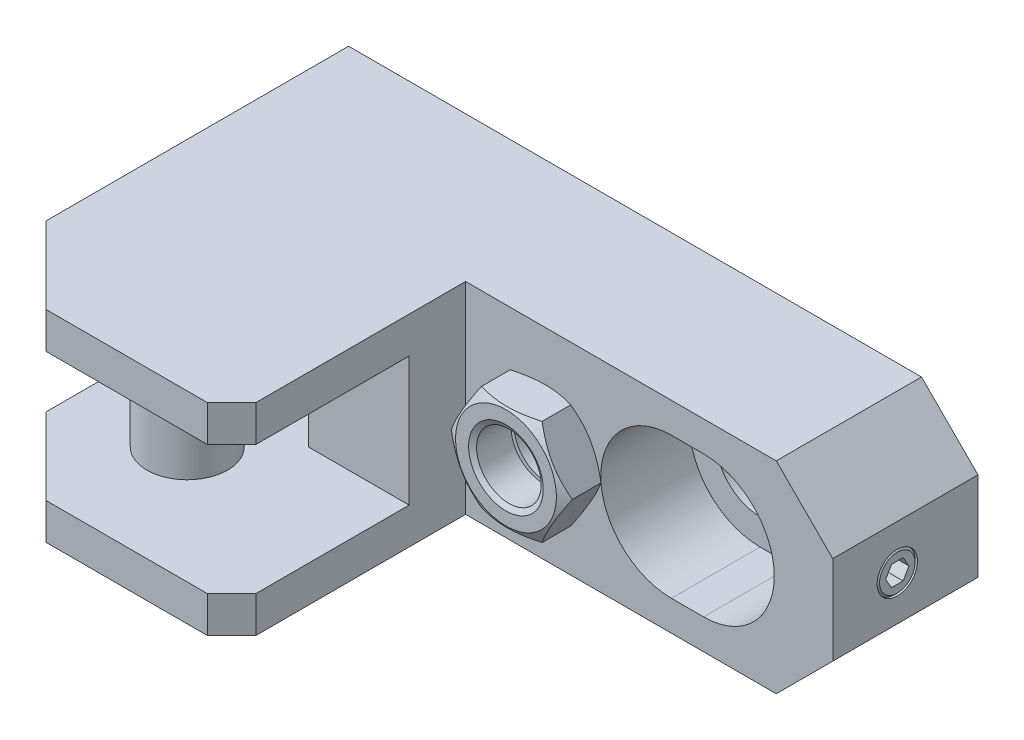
ISO-10303-21;
HEADER;
FILE_DESCRIPTION(('STEP AP214'),'2;1');
FILE_NAME('part.step','',(''),(''),'','','');
FILE_SCHEMA(('AUTOMOTIVE_DESIGN { 1 0 10303 214 1 1 1 1 }'));
ENDSEC;
DATA;
#1=APPLICATION_CONTEXT('core data for automotive mechanical design processes');
#2=APPLICATION_PROTOCOL_DEFINITION('international standard','automotive_design',2000,#1);
#3=PRODUCT_CONTEXT('',#1,'mechanical');
#4=PRODUCT('Part','Part','',(#3));
#5=PRODUCT_RELATED_PRODUCT_CATEGORY('part','',(#4));
#6=PRODUCT_DEFINITION_FORMATION('','',#4);
#7=PRODUCT_DEFINITION_CONTEXT('part definition',#1,'design');
#8=PRODUCT_DEFINITION('design','',#6,#7);
#9=PRODUCT_DEFINITION_SHAPE('','',#8);
#10=(LENGTH_UNIT() NAMED_UNIT(*) SI_UNIT(.MILLI.,.METRE.));
#11=(NAMED_UNIT(*) PLANE_ANGLE_UNIT() SI_UNIT($,.RADIAN.));
#12=(NAMED_UNIT(*) SI_UNIT($,.STERADIAN.) SOLID_ANGLE_UNIT());
#13=UNCERTAINTY_MEASURE_WITH_UNIT(LENGTH_MEASURE(1.E-05),#10,'distance_accuracy_value','');
#14=(GEOMETRIC_REPRESENTATION_CONTEXT(3) GLOBAL_UNCERTAINTY_ASSIGNED_CONTEXT((#13)) GLOBAL_UNIT_ASSIGNED_CONTEXT((#10,
#11,#12)) REPRESENTATION_CONTEXT('',''));
#15=CARTESIAN_POINT('',(0.,0.,0.));
#16=DIRECTION('',(0.,0.,1.));
#17=DIRECTION('',(1.,0.,0.));
#18=AXIS2_PLACEMENT_3D('',#15,#16,#17);
#19=CARTESIAN_POINT('',(13.9999999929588,2.87144629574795E-09,11.4433756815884));
#20=DIRECTION('',(6.35426511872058E-10,-0.5,-0.86602540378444));
#21=DIRECTION('',(0.,0.86602540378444,-0.5));
#22=AXIS2_PLACEMENT_3D('',#19,#20,#21);
#23=PLANE('',#22);
#24=DIRECTION('',(1.,-2.15160910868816E-10,3.72669629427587E-10));
#25=VECTOR('',#24,1.);
#26=CARTESIAN_POINT('',(13.9999999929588,3.71197583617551E-09,11.4433756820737));
#27=LINE('',#26,#25);
#28=CARTESIAN_POINT('',(15.9999999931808,3.28165183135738E-09,11.443375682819));
#29=VERTEX_POINT('',#28);
#30=CARTESIAN_POINT('',(13.9999999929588,3.02527329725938E-09,11.4433756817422));
#31=VERTEX_POINT('',#30);
#32=EDGE_CURVE('E1177',#29,#31,#27,.F.);
#33=ORIENTED_EDGE('',*,*,#32,.T.);
#34=DIRECTION('',(0.,0.86602540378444,-0.5));
#35=VECTOR('',#34,1.);
#36=CARTESIAN_POINT('',(13.9999999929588,2.87144629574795E-09,11.4433756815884));
#37=LINE('',#36,#35);
#38=CARTESIAN_POINT('',(13.9999999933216,1.25000000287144,10.7216878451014));
#39=VERTEX_POINT('',#38);
#40=EDGE_CURVE('E1181',#31,#39,#37,.T.);
#41=ORIENTED_EDGE('',*,*,#40,.T.);
#42=DIRECTION('',(-1.,-2.05102482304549E-10,0.));
#43=VECTOR('',#42,1.);
#44=CARTESIAN_POINT('',(13.9999999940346,1.25000000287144,10.7216878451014));
#45=LINE('',#44,#43);
#46=CARTESIAN_POINT('',(15.9999999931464,1.25000000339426,10.7216878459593));
#47=VERTEX_POINT('',#46);
#48=EDGE_CURVE('E1194',#39,#47,#45,.F.);
#49=ORIENTED_EDGE('',*,*,#48,.T.);
#50=DIRECTION('',(0.,0.86602540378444,-0.5));
#51=VECTOR('',#50,1.);
#52=CARTESIAN_POINT('',(15.9999999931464,3.50687280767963E-09,11.443375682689));
#53=LINE('',#52,#51);
#54=EDGE_CURVE('E1185',#47,#29,#53,.F.);
#55=ORIENTED_EDGE('',*,*,#54,.T.);
#56=EDGE_LOOP('',(#33,#41,#49,#55));
#57=FACE_BOUND('',#56,.T.);
#58=ADVANCED_FACE('F14',(#57),#23,.T.);
#59=CARTESIAN_POINT('',(13.9999999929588,2.87144629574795E-09,11.4433756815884));
#60=DIRECTION('',(-4.30321821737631E-10,-0.5,0.866025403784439));
#61=DIRECTION('',(0.,-0.866025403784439,-0.5));
#62=AXIS2_PLACEMENT_3D('',#59,#60,#61);
#63=PLANE('',#62);
#64=DIRECTION('',(0.,-0.866025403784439,-0.5));
#65=VECTOR('',#64,1.);
#66=CARTESIAN_POINT('',(15.9999999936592,2.44112447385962E-09,11.4433756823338));
#67=LINE('',#66,#65);
#68=CARTESIAN_POINT('',(15.9999999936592,-1.24999999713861,10.7216878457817));
#69=VERTEX_POINT('',#68);
#70=EDGE_CURVE('E1191',#69,#29,#67,.F.);
#71=ORIENTED_EDGE('',*,*,#70,.F.);
#72=DIRECTION('',(-1.,-2.05104690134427E-10,0.));
#73=VECTOR('',#72,1.);
#74=CARTESIAN_POINT('',(13.9999999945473,-1.24999999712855,10.7216878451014));
#75=LINE('',#74,#73);
#76=CARTESIAN_POINT('',(13.999999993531,-1.24999999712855,10.7216878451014));
#77=VERTEX_POINT('',#76);
#78=EDGE_CURVE('E1206',#77,#69,#75,.F.);
#79=ORIENTED_EDGE('',*,*,#78,.F.);
#80=DIRECTION('',(0.,-0.866025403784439,-0.5));
#81=VECTOR('',#80,1.);
#82=CARTESIAN_POINT('',(13.9999999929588,2.87144629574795E-09,11.4433756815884));
#83=LINE('',#82,#81);
#84=EDGE_CURVE('E1196',#31,#77,#83,.T.);
#85=ORIENTED_EDGE('',*,*,#84,.F.);
#86=ORIENTED_EDGE('',*,*,#32,.F.);
#87=EDGE_LOOP('',(#71,#79,#85,#86));
#88=FACE_BOUND('',#87,.T.);
#89=ADVANCED_FACE('F1129',(#88),#63,.F.);
#90=CARTESIAN_POINT('',(13.9999999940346,1.25000000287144,9.27831217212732));
#91=DIRECTION('',(-2.05102482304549E-10,1.,0.));
#92=DIRECTION('',(-1.,-2.05102482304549E-10,0.));
#93=AXIS2_PLACEMENT_3D('',#90,#91,#92);
#94=PLANE('',#93);
#95=DIRECTION('',(0.,0.,1.));
#96=VECTOR('',#95,1.);
#97=CARTESIAN_POINT('',(15.9999999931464,1.25000000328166,9.27831217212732));
#98=LINE('',#97,#96);
#99=CARTESIAN_POINT('',(15.9999999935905,1.25000000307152,9.27831217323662));
#100=VERTEX_POINT('',#99);
#101=EDGE_CURVE('E1203',#47,#100,#98,.F.);
#102=ORIENTED_EDGE('',*,*,#101,.F.);
#103=ORIENTED_EDGE('',*,*,#48,.F.);
#104=DIRECTION('',(0.,0.,1.));
#105=VECTOR('',#104,1.);
#106=CARTESIAN_POINT('',(13.9999999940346,1.25000000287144,9.27831217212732));
#107=LINE('',#106,#105);
#108=CARTESIAN_POINT('',(13.9999999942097,1.25000000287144,9.27831217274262));
#109=VERTEX_POINT('',#108);
#110=EDGE_CURVE('E1190',#109,#39,#107,.T.);
#111=ORIENTED_EDGE('',*,*,#110,.F.);
#112=DIRECTION('',(1.,-2.15160910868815E-10,3.72669629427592E-10));
#113=VECTOR('',#112,1.);
#114=CARTESIAN_POINT('',(13.999999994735,1.25000000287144,9.27831217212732));
#115=LINE('',#114,#113);
#116=EDGE_CURVE('E1209',#109,#100,#115,.T.);
#117=ORIENTED_EDGE('',*,*,#116,.T.);
#118=EDGE_LOOP('',(#102,#103,#111,#117));
#119=FACE_BOUND('',#118,.T.);
#120=ADVANCED_FACE('F1121',(#119),#94,.F.);
#121=CARTESIAN_POINT('',(13.9999999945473,-1.24999999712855,9.27831217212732));
#122=DIRECTION('',(-2.05104690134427E-10,1.,0.));
#123=DIRECTION('',(-1.,-2.05104690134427E-10,0.));
#124=AXIS2_PLACEMENT_3D('',#121,#122,#123);
#125=PLANE('',#124);
#126=DIRECTION('',(1.,3.17713255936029E-10,5.50295501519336E-10));
#127=VECTOR('',#126,1.);
#128=CARTESIAN_POINT('',(13.999999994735,-1.24999999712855,9.27831217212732));
#129=LINE('',#128,#127);
#130=CARTESIAN_POINT('',(13.9999999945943,-1.24999999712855,9.27831217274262));
#131=VERTEX_POINT('',#130);
#132=CARTESIAN_POINT('',(15.9999999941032,-1.24999999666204,9.27831217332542));
#133=VERTEX_POINT('',#132);
#134=EDGE_CURVE('E1219',#131,#133,#129,.T.);
#135=ORIENTED_EDGE('',*,*,#134,.F.);
#136=DIRECTION('',(6.15310087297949E-10,0.,-1.));
#137=VECTOR('',#136,1.);
#138=CARTESIAN_POINT('',(13.9999999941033,-1.24999999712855,10.0000000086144));
#139=LINE('',#138,#137);
#140=EDGE_CURVE('E1216',#77,#131,#139,.T.);
#141=ORIENTED_EDGE('',*,*,#140,.F.);
#142=ORIENTED_EDGE('',*,*,#78,.T.);
#143=DIRECTION('',(0.,0.,1.));
#144=VECTOR('',#143,1.);
#145=CARTESIAN_POINT('',(15.9999999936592,-1.24999999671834,9.27831217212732));
#146=LINE('',#145,#144);
#147=EDGE_CURVE('E157',#69,#133,#146,.F.);
#148=ORIENTED_EDGE('',*,*,#147,.T.);
#149=EDGE_LOOP('',(#135,#141,#142,#148));
#150=FACE_BOUND('',#149,.T.);
#151=ADVANCED_FACE('F1112',(#150),#125,.T.);
#152=CARTESIAN_POINT('',(13.999999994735,2.87144593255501E-09,8.55662433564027));
#153=DIRECTION('',(4.30321821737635E-10,0.499999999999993,-0.866025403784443));
#154=DIRECTION('',(0.,0.866025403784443,0.499999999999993));
#155=AXIS2_PLACEMENT_3D('',#152,#153,#154);
#156=PLANE('',#155);
#157=DIRECTION('',(1.,3.17713255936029E-10,5.50295501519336E-10));
#158=VECTOR('',#157,1.);
#159=CARTESIAN_POINT('',(13.999999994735,2.64622300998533E-09,8.55662433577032));
#160=LINE('',#159,#158);
#161=CARTESIAN_POINT('',(15.9999999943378,3.28165313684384E-09,8.55662433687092));
#162=VERTEX_POINT('',#161);
#163=CARTESIAN_POINT('',(13.999999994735,3.23540576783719E-09,8.55662433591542));
#164=VERTEX_POINT('',#163);
#165=EDGE_CURVE('E1224',#162,#164,#160,.F.);
#166=ORIENTED_EDGE('',*,*,#165,.F.);
#167=DIRECTION('',(0.,0.866025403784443,0.499999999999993));
#168=VECTOR('',#167,1.);
#169=CARTESIAN_POINT('',(15.9999999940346,2.44112411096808E-09,8.55662433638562));
#170=LINE('',#169,#168);
#171=EDGE_CURVE('E1211',#100,#162,#170,.F.);
#172=ORIENTED_EDGE('',*,*,#171,.F.);
#173=ORIENTED_EDGE('',*,*,#116,.F.);
#174=DIRECTION('',(-4.85280966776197E-10,0.866025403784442,0.499999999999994));
#175=VECTOR('',#174,1.);
#176=CARTESIAN_POINT('',(13.999999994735,2.8714457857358E-09,8.55662433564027));
#177=LINE('',#176,#175);
#178=EDGE_CURVE('E1213',#164,#109,#177,.T.);
#179=ORIENTED_EDGE('',*,*,#178,.F.);
#180=EDGE_LOOP('',(#166,#172,#173,#179));
#181=FACE_BOUND('',#180,.T.);
#182=ADVANCED_FACE('F1103',(#181),#156,.F.);
#183=CARTESIAN_POINT('',(13.9999999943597,-2.49999999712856,10.0000000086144));
#184=DIRECTION('',(1.,2.05104690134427E-10,6.15310087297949E-10));
#185=DIRECTION('',(6.15310087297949E-10,0.,-1.));
#186=AXIS2_PLACEMENT_3D('',#183,#184,#185);
#187=PLANE('',#186);
#188=ORIENTED_EDGE('',*,*,#84,.T.);
#189=ORIENTED_EDGE('',*,*,#140,.T.);
#190=DIRECTION('',(0.,-0.866025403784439,0.5));
#191=VECTOR('',#190,1.);
#192=CARTESIAN_POINT('',(13.999999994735,2.87144593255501E-09,8.55662433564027));
#193=LINE('',#192,#191);
#194=EDGE_CURVE('E338',#164,#131,#193,.T.);
#195=ORIENTED_EDGE('',*,*,#194,.F.);
#196=ORIENTED_EDGE('',*,*,#178,.T.);
#197=ORIENTED_EDGE('',*,*,#110,.T.);
#198=ORIENTED_EDGE('',*,*,#40,.F.);
#199=EDGE_LOOP('',(#188,#189,#195,#196,#197,#198));
#200=FACE_BOUND('',#199,.T.);
#201=ADVANCED_FACE('F1094',(#200),#187,.T.);
#202=CARTESIAN_POINT('',(13.999999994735,2.87144593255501E-09,8.55662433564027));
#203=DIRECTION('',(-6.35426511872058E-10,0.5,0.866025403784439));
#204=DIRECTION('',(0.,-0.866025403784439,0.5));
#205=AXIS2_PLACEMENT_3D('',#202,#203,#204);
#206=PLANE('',#205);
#207=ORIENTED_EDGE('',*,*,#165,.T.);
#208=ORIENTED_EDGE('',*,*,#194,.T.);
#209=ORIENTED_EDGE('',*,*,#134,.T.);
#210=DIRECTION('',(1.30029171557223E-10,0.86602540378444,-0.5));
#211=VECTOR('',#210,1.);
#212=CARTESIAN_POINT('',(15.9999999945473,-1.24999999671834,9.27831217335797));
#213=LINE('',#212,#211);
#214=EDGE_CURVE('E337',#133,#162,#213,.T.);
#215=ORIENTED_EDGE('',*,*,#214,.T.);
#216=EDGE_LOOP('',(#207,#208,#209,#215));
#217=FACE_BOUND('',#216,.T.);
#218=ADVANCED_FACE('F1085',(#217),#206,.T.);
#219=CARTESIAN_POINT('',(-19.5000000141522,-3.99951287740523E-09,22.9999999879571));
#220=DIRECTION('',(-6.15310355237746E-10,0.,1.));
#221=DIRECTION('',(1.,0.,6.15310355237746E-10));
#222=AXIS2_PLACEMENT_3D('',#219,#220,#221);
#223=CONICAL_SURFACE('',#222,4.62499999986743,1.04719755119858);
#224=CARTESIAN_POINT('',(-19.5000000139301,-3.99951315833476E-09,22.6391560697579));
#225=DIRECTION('',(6.15310285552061E-10,0.,-1.));
#226=DIRECTION('',(-1.,0.,-6.15310285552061E-10));
#227=AXIS2_PLACEMENT_3D('',#224,#225,#226);
#228=CIRCLE('',#227,4.);
#229=CARTESIAN_POINT('',(-23.5000000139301,-3.99951315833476E-09,22.6391560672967));
#230=VERTEX_POINT('',#229);
#231=EDGE_CURVE('E334',#230,#230,#228,.T.);
#232=ORIENTED_EDGE('',*,*,#231,.T.);
#233=EDGE_LOOP('',(#232));
#234=FACE_BOUND('',#233,.T.);
#235=CARTESIAN_POINT('',(-19.5000000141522,-3.99951287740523E-09,22.9999999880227));
#236=DIRECTION('',(-6.15310355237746E-10,0.,1.));
#237=DIRECTION('',(1.,0.,6.15310355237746E-10));
#238=AXIS2_PLACEMENT_3D('',#235,#236,#237);
#239=CIRCLE('',#238,4.62499999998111);
#240=CARTESIAN_POINT('',(-14.875000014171,-3.99951287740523E-09,22.9999999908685));
#241=VERTEX_POINT('',#240);
#242=EDGE_CURVE('E18',#241,#241,#239,.F.);
#243=ORIENTED_EDGE('',*,*,#242,.F.);
#244=EDGE_LOOP('',(#243));
#245=FACE_BOUND('',#244,.T.);
#246=ADVANCED_FACE('F1076',(#234,#245),#223,.F.);
#247=CARTESIAN_POINT('',(-19.5000000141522,-3.99951294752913E-09,22.9999999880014));
#248=DIRECTION('',(6.15310285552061E-10,0.,-1.));
#249=DIRECTION('',(-1.,0.,-6.15310285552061E-10));
#250=AXIS2_PLACEMENT_3D('',#247,#248,#249);
#251=CYLINDRICAL_SURFACE('',#250,4.);
#252=ORIENTED_EDGE('',*,*,#231,.F.);
#253=EDGE_LOOP('',(#252));
#254=FACE_BOUND('',#253,.T.);
#255=CARTESIAN_POINT('',(-19.5000000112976,-3.99951565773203E-09,18.360843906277));
#256=DIRECTION('',(6.15310285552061E-10,0.,-1.));
#257=DIRECTION('',(4.1020659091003E-10,-1.,0.));
#258=AXIS2_PLACEMENT_3D('',#255,#256,#257);
#259=CIRCLE('',#258,4.00000000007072);
#260=CARTESIAN_POINT('',(-19.5000000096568,-4.00000000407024,18.360843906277));
#261=VERTEX_POINT('',#260);
#262=EDGE_CURVE('E330',#261,#261,#259,.T.);
#263=ORIENTED_EDGE('',*,*,#262,.T.);
#264=EDGE_LOOP('',(#263));
#265=FACE_BOUND('',#264,.T.);
#266=ADVANCED_FACE('F1067',(#254,#265),#251,.F.);
#267=CARTESIAN_POINT('',(15.9999999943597,-2.49999999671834,10.000000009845));
#268=DIRECTION('',(-1.,-2.05104690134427E-10,-6.15310087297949E-10));
#269=DIRECTION('',(-6.15310087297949E-10,0.,1.));
#270=AXIS2_PLACEMENT_3D('',#267,#268,#269);
#271=PLANE('',#270);
#272=ORIENTED_EDGE('',*,*,#147,.F.);
#273=ORIENTED_EDGE('',*,*,#70,.T.);
#274=ORIENTED_EDGE('',*,*,#54,.F.);
#275=ORIENTED_EDGE('',*,*,#101,.T.);
#276=ORIENTED_EDGE('',*,*,#171,.T.);
#277=ORIENTED_EDGE('',*,*,#214,.F.);
#278=EDGE_LOOP('',(#272,#273,#274,#275,#276,#277));
#279=FACE_BOUND('',#278,.T.);
#280=CARTESIAN_POINT('',(15.9999999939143,3.28164987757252E-09,10.000000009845));
#281=DIRECTION('',(-1.,-2.05102482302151E-10,-6.15310092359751E-10));
#282=DIRECTION('',(-6.15310092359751E-10,0.,1.));
#283=AXIS2_PLACEMENT_3D('',#280,#281,#282);
#284=CIRCLE('',#283,2.2000000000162);
#285=CARTESIAN_POINT('',(15.9999999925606,3.28164987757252E-09,12.2000000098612));
#286=VERTEX_POINT('',#285);
#287=EDGE_CURVE('E333',#286,#286,#284,.T.);
#288=ORIENTED_EDGE('',*,*,#287,.F.);
#289=EDGE_LOOP('',(#288));
#290=FACE_BOUND('',#289,.T.);
#291=ADVANCED_FACE('F1058',(#279,#290),#271,.F.);
#292=CARTESIAN_POINT('',(-27.0055535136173,-7.07834283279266E-09,22.9999999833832));
#293=DIRECTION('',(-6.1531028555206E-10,0.,1.));
#294=DIRECTION('',(1.,0.,6.1531028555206E-10));
#295=AXIS2_PLACEMENT_3D('',#292,#293,#294);
#296=PLANE('',#295);
#297=CARTESIAN_POINT('',(-19.5000000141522,-3.99951297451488E-09,22.9999999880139));
#298=DIRECTION('',(6.15310135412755E-10,0.,-1.));
#299=DIRECTION('',(-1.,0.,-6.15310135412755E-10));
#300=AXIS2_PLACEMENT_3D('',#297,#298,#299);
#301=CIRCLE('',#300,6.25000000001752);
#302=CARTESIAN_POINT('',(-25.7500000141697,-3.99951297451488E-09,22.9999999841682));
#303=VERTEX_POINT('',#302);
#304=EDGE_CURVE('E1257',#303,#303,#301,.T.);
#305=ORIENTED_EDGE('',*,*,#304,.F.);
#306=EDGE_LOOP('',(#305));
#307=FACE_BOUND('',#306,.T.);
#308=ORIENTED_EDGE('',*,*,#242,.T.);
#309=EDGE_LOOP('',(#308));
#310=FACE_BOUND('',#309,.T.);
#311=ADVANCED_FACE('F1050',(#307,#310),#296,.T.);
#312=CARTESIAN_POINT('',(-19.5000000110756,-3.99951591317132E-09,17.9999999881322));
#313=DIRECTION('',(6.15310355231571E-10,0.,-1.));
#314=DIRECTION('',(-1.,0.,-6.15310355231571E-10));
#315=AXIS2_PLACEMENT_3D('',#312,#313,#314);
#316=CONICAL_SURFACE('',#315,4.62499999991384,1.04719755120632);
#317=ORIENTED_EDGE('',*,*,#262,.F.);
#318=EDGE_LOOP('',(#317));
#319=FACE_BOUND('',#318,.T.);
#320=CARTESIAN_POINT('',(-19.5000000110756,-3.99951591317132E-09,17.9999999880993));
#321=DIRECTION('',(6.15310355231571E-10,0.,-1.));
#322=DIRECTION('',(-1.,0.,-6.15310355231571E-10));
#323=AXIS2_PLACEMENT_3D('',#320,#321,#322);
#324=CIRCLE('',#323,4.62499999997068);
#325=CARTESIAN_POINT('',(-24.1250000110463,-3.99951591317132E-09,17.9999999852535));
#326=VERTEX_POINT('',#325);
#327=EDGE_CURVE('E329',#326,#326,#324,.T.);
#328=ORIENTED_EDGE('',*,*,#327,.T.);
#329=EDGE_LOOP('',(#328));
#330=FACE_BOUND('',#329,.T.);
#331=ADVANCED_FACE('F1042',(#319,#330),#316,.F.);
#332=CARTESIAN_POINT('',(15.6999999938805,3.22011913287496E-09,10.0000000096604));
#333=DIRECTION('',(-1.,-2.05102482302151E-10,-6.15310092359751E-10));
#334=DIRECTION('',(-6.15310092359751E-10,0.,1.));
#335=AXIS2_PLACEMENT_3D('',#332,#333,#334);
#336=CONICAL_SURFACE('',#335,2.50000000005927,0.785398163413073);
#337=ORIENTED_EDGE('',*,*,#287,.T.);
#338=EDGE_LOOP('',(#337));
#339=FACE_BOUND('',#338,.T.);
#340=CARTESIAN_POINT('',(15.6999999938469,3.22012828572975E-09,10.0000000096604));
#341=DIRECTION('',(1.,2.05103428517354E-10,6.1531028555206E-10));
#342=DIRECTION('',(6.1531028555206E-10,0.,-1.));
#343=AXIS2_PLACEMENT_3D('',#340,#341,#342);
#344=CIRCLE('',#343,2.5);
#345=CARTESIAN_POINT('',(15.6999999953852,3.22012828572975E-09,7.50000000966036));
#346=VERTEX_POINT('',#345);
#347=EDGE_CURVE('E326',#346,#346,#344,.T.);
#348=ORIENTED_EDGE('',*,*,#347,.T.);
#349=EDGE_LOOP('',(#348));
#350=FACE_BOUND('',#349,.T.);
#351=ADVANCED_FACE('F459',(#339,#350),#336,.T.);
#352=CARTESIAN_POINT('',(-19.5000000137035,-3.9995133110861E-09,22.2707564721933));
#353=DIRECTION('',(6.15310135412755E-10,0.,-1.));
#354=DIRECTION('',(-1.,0.,-6.15310135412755E-10));
#355=AXIS2_PLACEMENT_3D('',#352,#353,#354);
#356=CONICAL_SURFACE('',#355,7.51308682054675,1.04719755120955);
#357=ORIENTED_EDGE('',*,*,#304,.T.);
#358=EDGE_LOOP('',(#357));
#359=FACE_BOUND('',#358,.T.);
#360=CARTESIAN_POINT('',(-11.9944465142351,-9.3087879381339E-10,22.2751058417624));
#361=CARTESIAN_POINT('',(-12.0769358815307,0.14287577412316,22.3227219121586));
#362=CARTESIAN_POINT('',(-12.1597328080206,0.286284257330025,22.3681768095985));
#363=CARTESIAN_POINT('',(-12.325999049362,0.574265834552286,22.4541690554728));
#364=CARTESIAN_POINT('',(-12.4094686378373,0.718839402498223,22.4947042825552));
#365=CARTESIAN_POINT('',(-12.6612137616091,1.15487474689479,22.6081347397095));
#366=CARTESIAN_POINT('',(-12.8304829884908,1.44805764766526,22.672651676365));
#367=CARTESIAN_POINT('',(-13.0837912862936,1.88680048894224,22.7483035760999));
#368=CARTESIAN_POINT('',(-13.1670735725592,2.03104963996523,22.7698542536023));
#369=CARTESIAN_POINT('',(-13.3340144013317,2.32019963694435,22.8059907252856));
#370=CARTESIAN_POINT('',(-13.417672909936,2.46510042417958,22.8205771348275));
#371=CARTESIAN_POINT('',(-13.5851351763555,2.75515357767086,22.8424133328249));
#372=CARTESIAN_POINT('',(-13.6689386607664,2.90030547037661,22.849671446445));
#373=CARTESIAN_POINT('',(-13.8366183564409,3.19073522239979,22.856703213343));
#374=CARTESIAN_POINT('',(-13.9204945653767,3.33601307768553,22.8564770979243));
#375=CARTESIAN_POINT('',(-14.1502736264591,3.73400208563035,22.845570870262));
#376=CARTESIAN_POINT('',(-14.2961012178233,3.98658288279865,22.827271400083));
#377=CARTESIAN_POINT('',(-14.5867878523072,4.49006690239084,22.7692498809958));
#378=CARTESIAN_POINT('',(-14.7316458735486,4.74096835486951,22.7295080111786));
#379=CARTESIAN_POINT('',(-15.0229172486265,5.24546517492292,22.6301673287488));
#380=CARTESIAN_POINT('',(-15.169293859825,5.49899690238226,22.5701477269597));
#381=CARTESIAN_POINT('',(-15.4598645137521,6.00228003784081,22.4339283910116));
#382=CARTESIAN_POINT('',(-15.6040622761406,6.25203788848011,22.3577606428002));
#383=CARTESIAN_POINT('',(-15.7472232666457,6.49999999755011,22.2751058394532));
#384=B_SPLINE_CURVE_WITH_KNOTS('',3,(#360,#361,#362,#363,#364,#365,#366,#367,#368,#369,#370,
#371,#372,#373,#374,#375,#376,#377,#378,#379,#380,#381,#382,#383),.UNSPECIFIED.,.F.,.F.,(4,2,2,
2,2,2,2,2,2,2,2,4),(0.,0.515097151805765,1.03041562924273,2.06319349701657,2.56693469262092,
3.0706313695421,3.57375518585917,4.07686345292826,4.95263085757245,5.82920919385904,
6.72522583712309,7.61948397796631),.UNSPECIFIED.);
#385=CARTESIAN_POINT('',(-11.994446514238,-9.2577290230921E-10,22.2751058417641));
#386=VERTEX_POINT('',#385);
#387=CARTESIAN_POINT('',(-15.7472232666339,6.4999999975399,22.2751058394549));
#388=VERTEX_POINT('',#387);
#389=EDGE_CURVE('E465',#386,#388,#384,.T.);
#390=ORIENTED_EDGE('',*,*,#389,.T.);
#391=CARTESIAN_POINT('',(-15.747223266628,6.4999999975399,22.2751058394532));
#392=CARTESIAN_POINT('',(-16.0552890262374,6.49999999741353,22.364046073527));
#393=CARTESIAN_POINT('',(-16.3657918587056,6.49999999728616,22.445473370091));
#394=CARTESIAN_POINT('',(-16.9918414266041,6.49999999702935,22.5893860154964));
#395=CARTESIAN_POINT('',(-17.3073978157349,6.49999999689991,22.6518289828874));
#396=CARTESIAN_POINT('',(-17.9349697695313,6.49999999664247,22.7522448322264));
#397=CARTESIAN_POINT('',(-18.2468969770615,6.49999999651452,22.7907530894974));
#398=CARTESIAN_POINT('',(-18.8725510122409,6.49999999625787,22.8424481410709));
#399=CARTESIAN_POINT('',(-19.1862755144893,6.49999999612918,22.8556624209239));
#400=CARTESIAN_POINT('',(-19.81372451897,6.4999999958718,22.8556624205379));
#401=CARTESIAN_POINT('',(-20.1274490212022,6.4999999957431,22.8424481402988));
#402=CARTESIAN_POINT('',(-20.7531030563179,6.49999999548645,22.7907530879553));
#403=CARTESIAN_POINT('',(-21.0650302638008,6.4999999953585,22.7522448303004));
#404=CARTESIAN_POINT('',(-21.6926022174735,6.49999999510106,22.6518289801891));
#405=CARTESIAN_POINT('',(-22.0081586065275,6.49999999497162,22.5893860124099));
#406=CARTESIAN_POINT('',(-22.6342081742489,6.49999999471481,22.445473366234));
#407=CARTESIAN_POINT('',(-22.9447110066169,6.49999999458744,22.3640460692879));
#408=CARTESIAN_POINT('',(-23.2527767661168,6.49999999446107,22.275105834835));
#409=B_SPLINE_CURVE_WITH_KNOTS('',3,(#391,#392,#393,#394,#395,#396,#397,#398,#399,#400,#401,
#402,#403,#404,#405,#406,#407,#408),.UNSPECIFIED.,.F.,.F.,(4,2,2,2,2,2,2,2,4),(0.,
0.962238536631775,1.92660970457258,2.86855029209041,3.80946674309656,4.7503831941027,
5.69232378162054,6.65669494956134,7.61893348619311),.UNSPECIFIED.);
#410=CARTESIAN_POINT('',(-23.2527767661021,6.49999999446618,22.2751058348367));
#411=VERTEX_POINT('',#410);
#412=EDGE_CURVE('E473',#388,#411,#409,.T.);
#413=ORIENTED_EDGE('',*,*,#412,.T.);
#414=CARTESIAN_POINT('',(-23.2527767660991,6.49999999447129,22.275105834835));
#415=CARTESIAN_POINT('',(-23.3352661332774,6.35712421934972,22.3227219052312));
#416=CARTESIAN_POINT('',(-23.4180630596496,6.21371573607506,22.3681768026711));
#417=CARTESIAN_POINT('',(-23.5843293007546,5.92573415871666,22.4541690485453));
#418=CARTESIAN_POINT('',(-23.6677988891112,5.78116059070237,22.4947042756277));
#419=CARTESIAN_POINT('',(-23.919544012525,5.34512524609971,22.6081347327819));
#420=CARTESIAN_POINT('',(-24.088813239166,5.05194234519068,22.6726516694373));
#421=CARTESIAN_POINT('',(-24.3421215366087,4.61319950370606,22.7483035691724));
#422=CARTESIAN_POINT('',(-24.4254038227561,4.4689503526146,22.7698542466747));
#423=CARTESIAN_POINT('',(-24.5923446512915,4.17980035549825,22.8059907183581));
#424=CARTESIAN_POINT('',(-24.676003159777,4.03489956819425,22.8205771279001));
#425=CARTESIAN_POINT('',(-24.8434654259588,3.74484641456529,22.8424133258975));
#426=CARTESIAN_POINT('',(-24.9272689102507,3.59969452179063,22.8496714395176));
#427=CARTESIAN_POINT('',(-25.094948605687,3.30926476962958,22.8567032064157));
#428=CARTESIAN_POINT('',(-25.1788248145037,3.16398691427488,22.8564770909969));
#429=CARTESIAN_POINT('',(-25.4086038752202,2.76599790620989,22.8455708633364));
#430=CARTESIAN_POINT('',(-25.5544314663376,2.51341710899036,22.8272713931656));
#431=CARTESIAN_POINT('',(-25.8451181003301,2.00993308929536,22.7692498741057));
#432=CARTESIAN_POINT('',(-25.9899761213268,1.7590316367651,22.7295080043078));
#433=CARTESIAN_POINT('',(-26.2812474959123,1.25453481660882,22.6301673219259));
#434=CARTESIAN_POINT('',(-26.4276241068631,1.00100308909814,22.5701477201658));
#435=CARTESIAN_POINT('',(-26.7181947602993,0.497719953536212,22.4339283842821));
#436=CARTESIAN_POINT('',(-26.8623925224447,0.247962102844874,22.3577606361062));
#437=CARTESIAN_POINT('',(-27.0055535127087,-6.27723637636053E-09,22.2751058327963));
#438=B_SPLINE_CURVE_WITH_KNOTS('',3,(#414,#415,#416,#417,#418,#419,#420,#421,#422,#423,#424,
#425,#426,#427,#428,#429,#430,#431,#432,#433,#434,#435,#436,#437),.UNSPECIFIED.,.F.,.F.,(4,2,2,
2,2,2,2,2,2,2,2,4),(0.,0.515097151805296,1.0304156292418,2.06319349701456,2.56693469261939,
3.07063136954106,3.57375518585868,4.07686345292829,4.95263085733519,5.82920919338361,
6.72522583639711,7.61948397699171),.UNSPECIFIED.);
#439=CARTESIAN_POINT('',(-27.0055535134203,-6.64693315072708E-09,22.2751058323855));
#440=VERTEX_POINT('',#439);
#441=EDGE_CURVE('E446',#411,#440,#438,.T.);
#442=ORIENTED_EDGE('',*,*,#441,.T.);
#443=CARTESIAN_POINT('',(-27.0055535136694,-6.21553001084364E-09,22.2751058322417));
#444=CARTESIAN_POINT('',(-26.9230641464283,-0.142875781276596,22.3227219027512));
#445=CARTESIAN_POINT('',(-26.8402672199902,-0.286284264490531,22.368176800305));
#446=CARTESIAN_POINT('',(-26.6740009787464,-0.574265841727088,22.4541690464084));
#447=CARTESIAN_POINT('',(-26.5905313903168,-0.718839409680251,22.4947042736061));
#448=CARTESIAN_POINT('',(-26.3387862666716,-1.15487475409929,22.6081347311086));
#449=CARTESIAN_POINT('',(-26.1695170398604,-1.44805765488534,22.6726516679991));
#450=CARTESIAN_POINT('',(-25.9162087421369,-1.8868004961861,22.7483035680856));
#451=CARTESIAN_POINT('',(-25.8329264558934,-2.03104964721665,22.7698542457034));
#452=CARTESIAN_POINT('',(-25.6659856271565,-2.32019964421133,22.8059907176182));
#453=CARTESIAN_POINT('',(-25.5823271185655,-2.46510043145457,22.820577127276));
#454=CARTESIAN_POINT('',(-25.4148648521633,-2.75515358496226,22.8424133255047));
#455=CARTESIAN_POINT('',(-25.3310613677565,-2.90030547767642,22.8496714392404));
#456=CARTESIAN_POINT('',(-25.1633816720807,-3.19073522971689,22.8567032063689));
#457=CARTESIAN_POINT('',(-25.0795054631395,-3.3360130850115,22.8564770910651));
#458=CARTESIAN_POINT('',(-24.8497264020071,-3.73400209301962,22.8455708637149));
#459=CARTESIAN_POINT('',(-24.7038988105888,-3.98658289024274,22.8272713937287));
#460=CARTESIAN_POINT('',(-24.4132121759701,-4.49006690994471,22.7692498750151));
#461=CARTESIAN_POINT('',(-24.2683541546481,-4.74096836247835,22.7295080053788));
#462=CARTESIAN_POINT('',(-23.9770827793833,-5.24546518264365,22.6301673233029));
#463=CARTESIAN_POINT('',(-23.8307061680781,-5.49899691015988,22.5701477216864));
#464=CARTESIAN_POINT('',(-23.5401355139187,-6.00228004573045,22.4339283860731));
#465=CARTESIAN_POINT('',(-23.3959377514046,-6.25203789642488,22.357760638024));
#466=CARTESIAN_POINT('',(-23.2527767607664,-6.50000000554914,22.275105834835));
#467=B_SPLINE_CURVE_WITH_KNOTS('',3,(#443,#444,#445,#446,#447,#448,#449,#450,#451,#452,#453,
#454,#455,#456,#457,#458,#459,#460,#461,#462,#463,#464,#465,#466),.UNSPECIFIED.,.F.,.F.,(4,2,2,
2,2,2,2,2,2,2,2,4),(0.,0.515097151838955,1.03041562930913,2.0631934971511,2.56693469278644,
3.07063136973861,3.57375518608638,4.07686345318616,4.95263085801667,5.82920919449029,
6.72522583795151,7.61948397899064),.UNSPECIFIED.);
#468=CARTESIAN_POINT('',(-23.2527767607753,-6.50000000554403,22.275105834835));
#469=VERTEX_POINT('',#468);
#470=EDGE_CURVE('E148',#440,#469,#467,.T.);
#471=ORIENTED_EDGE('',*,*,#470,.T.);
#472=CARTESIAN_POINT('',(-23.2527767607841,-6.50000000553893,22.275105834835));
#473=CARTESIAN_POINT('',(-22.9447110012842,-6.50000000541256,22.3640460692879));
#474=CARTESIAN_POINT('',(-22.6342081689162,-6.50000000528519,22.445473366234));
#475=CARTESIAN_POINT('',(-22.0081586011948,-6.50000000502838,22.5893860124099));
#476=CARTESIAN_POINT('',(-21.6926022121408,-6.50000000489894,22.6518289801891));
#477=CARTESIAN_POINT('',(-21.0650302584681,-6.5000000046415,22.7522448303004));
#478=CARTESIAN_POINT('',(-20.7531030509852,-6.50000000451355,22.7907530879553));
#479=CARTESIAN_POINT('',(-20.1274490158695,-6.5000000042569,22.8424481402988));
#480=CARTESIAN_POINT('',(-19.8137245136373,-6.5000000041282,22.8556624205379));
#481=CARTESIAN_POINT('',(-19.1862755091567,-6.50000000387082,22.855662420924));
#482=CARTESIAN_POINT('',(-18.8725510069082,-6.50000000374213,22.842448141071));
#483=CARTESIAN_POINT('',(-18.2468969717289,-6.50000000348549,22.7907530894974));
#484=CARTESIAN_POINT('',(-17.9349697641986,-6.50000000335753,22.7522448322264));
#485=CARTESIAN_POINT('',(-17.3073978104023,-6.50000000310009,22.6518289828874));
#486=CARTESIAN_POINT('',(-16.9918414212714,-6.50000000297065,22.5893860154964));
#487=CARTESIAN_POINT('',(-16.365791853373,-6.50000000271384,22.445473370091));
#488=CARTESIAN_POINT('',(-16.0552890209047,-6.50000000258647,22.364046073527));
#489=CARTESIAN_POINT('',(-15.7472232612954,-6.5000000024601,22.2751058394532));
#490=B_SPLINE_CURVE_WITH_KNOTS('',3,(#472,#473,#474,#475,#476,#477,#478,#479,#480,#481,#482,
#483,#484,#485,#486,#487,#488,#489),.UNSPECIFIED.,.F.,.F.,(4,2,2,2,2,2,2,2,4),(0.,
0.962238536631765,1.92660970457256,2.86855029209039,3.80946674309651,4.75038319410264,
5.69232378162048,6.65669494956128,7.61893348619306),.UNSPECIFIED.);
#491=CARTESIAN_POINT('',(-15.7472232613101,-6.5000000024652,22.2751058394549));
#492=VERTEX_POINT('',#491);
#493=EDGE_CURVE('E480',#469,#492,#490,.T.);
#494=ORIENTED_EDGE('',*,*,#493,.T.);
#495=CARTESIAN_POINT('',(-15.747223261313,-6.5000000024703,22.2751058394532));
#496=CARTESIAN_POINT('',(-15.6647338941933,-6.35712422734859,22.322721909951));
#497=CARTESIAN_POINT('',(-15.5819369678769,-6.2137157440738,22.3681768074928));
#498=CARTESIAN_POINT('',(-15.4156707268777,-5.92573416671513,22.4541690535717));
#499=CARTESIAN_POINT('',(-15.3322011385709,-5.78116059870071,22.4947042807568));
#500=CARTESIAN_POINT('',(-15.0804560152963,-5.34512525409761,22.6081347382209));
#501=CARTESIAN_POINT('',(-14.9111867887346,-5.05194235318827,22.6726516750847));
#502=CARTESIAN_POINT('',(-14.6578784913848,-4.61319951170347,22.7483035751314));
#503=CARTESIAN_POINT('',(-14.574596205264,-4.46895036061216,22.7698542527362));
#504=CARTESIAN_POINT('',(-14.4076553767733,-4.17980036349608,22.805990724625));
#505=CARTESIAN_POINT('',(-14.3239968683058,-4.03489957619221,22.8205771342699));
#506=CARTESIAN_POINT('',(-14.1565346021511,-3.74484642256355,22.8424133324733));
#507=CARTESIAN_POINT('',(-14.0727311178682,-3.59969452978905,22.8496714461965));
#508=CARTESIAN_POINT('',(-13.9050514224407,-3.3092647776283,22.8567032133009));
#509=CARTESIAN_POINT('',(-13.8211752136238,-3.16398692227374,22.8564770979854));
#510=CARTESIAN_POINT('',(-13.5913961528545,-2.76599791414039,22.8455708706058));
#511=CARTESIAN_POINT('',(-13.445568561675,-2.51341711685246,22.8272714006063));
#512=CARTESIAN_POINT('',(-13.1548819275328,-2.00993309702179,22.7692498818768));
#513=CARTESIAN_POINT('',(-13.0100239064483,-1.75903164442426,22.729508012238));
#514=CARTESIAN_POINT('',(-12.718752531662,-1.25453482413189,22.6301673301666));
#515=CARTESIAN_POINT('',(-12.5723759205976,-1.00100309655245,22.5701477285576));
#516=CARTESIAN_POINT('',(-12.2818052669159,-0.497719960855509,22.433928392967));
#517=CARTESIAN_POINT('',(-12.1376075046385,-0.247962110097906,22.3577606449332));
#518=CARTESIAN_POINT('',(-11.994446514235,-9.1045777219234E-10,22.2751058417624));
#519=B_SPLINE_CURVE_WITH_KNOTS('',3,(#495,#496,#497,#498,#499,#500,#501,#502,#503,#504,#505,
#506,#507,#508,#509,#510,#511,#512,#513,#514,#515,#516,#517,#518),.UNSPECIFIED.,.F.,.F.,(4,2,2,
2,2,2,2,2,2,2,2,4),(0.,0.515097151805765,1.03041562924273,2.06319349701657,2.56693469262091,
3.07063136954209,3.57375518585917,4.07686345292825,4.95263085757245,5.82920919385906,
6.72522583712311,7.61948397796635),.UNSPECIFIED.);
#520=EDGE_CURVE('E491',#492,#386,#519,.T.);
#521=ORIENTED_EDGE('',*,*,#520,.T.);
#522=EDGE_LOOP('',(#390,#413,#442,#471,#494,#521));
#523=FACE_BOUND('',#522,.T.);
#524=ADVANCED_FACE('F453',(#359,#523),#356,.T.);
#525=CARTESIAN_POINT('',(-29.5000000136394,12.4999999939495,17.9999999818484));
#526=DIRECTION('',(6.15310133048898E-10,0.,-1.));
#527=DIRECTION('',(-1.,0.,-6.15310133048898E-10));
#528=AXIS2_PLACEMENT_3D('',#525,#526,#527);
#529=PLANE('',#528);
#530=ORIENTED_EDGE('',*,*,#327,.F.);
#531=EDGE_LOOP('',(#530));
#532=FACE_BOUND('',#531,.T.);
#533=CARTESIAN_POINT('',(-19.5000000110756,-3.99951662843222E-09,17.9999999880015));
#534=DIRECTION('',(-6.15310189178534E-10,0.,1.));
#535=DIRECTION('',(1.,0.,6.15310189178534E-10));
#536=AXIS2_PLACEMENT_3D('',#533,#534,#535);
#537=CIRCLE('',#536,4.);
#538=CARTESIAN_POINT('',(-15.5000000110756,-3.99951662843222E-09,17.9999999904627));
#539=VERTEX_POINT('',#538);
#540=EDGE_CURVE('E489',#539,#539,#537,.F.);
#541=ORIENTED_EDGE('',*,*,#540,.T.);
#542=EDGE_LOOP('',(#541));
#543=FACE_BOUND('',#542,.T.);
#544=ADVANCED_FACE('F458',(#532,#543),#529,.F.);
#545=CARTESIAN_POINT('',(15.9999999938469,3.28165931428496E-09,10.000000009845));
#546=DIRECTION('',(1.,2.05103428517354E-10,6.1531028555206E-10));
#547=DIRECTION('',(6.1531028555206E-10,0.,-1.));
#548=AXIS2_PLACEMENT_3D('',#545,#546,#547);
#549=CYLINDRICAL_SURFACE('',#548,2.5);
#550=ORIENTED_EDGE('',*,*,#347,.F.);
#551=EDGE_LOOP('',(#550));
#552=FACE_BOUND('',#551,.T.);
#553=CARTESIAN_POINT('',(15.9999999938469,3.28165931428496E-09,10.000000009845));
#554=DIRECTION('',(1.,2.05103428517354E-10,6.1531028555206E-10));
#555=DIRECTION('',(6.1531028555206E-10,0.,-1.));
#556=AXIS2_PLACEMENT_3D('',#553,#554,#555);
#557=CIRCLE('',#556,2.5);
#558=CARTESIAN_POINT('',(15.9999999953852,3.28165931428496E-09,7.50000000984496));
#559=VERTEX_POINT('',#558);
#560=EDGE_CURVE('E550',#559,#559,#557,.T.);
#561=ORIENTED_EDGE('',*,*,#560,.T.);
#562=EDGE_LOOP('',(#561));
#563=FACE_BOUND('',#562,.T.);
#564=ADVANCED_FACE('F1016',(#552,#563),#549,.F.);
#565=CARTESIAN_POINT('',(-4.00000000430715,-8.2041507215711E-10,6.99999999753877));
#566=DIRECTION('',(6.15310183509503E-10,0.,-1.));
#567=DIRECTION('',(-1.,0.,-6.15310183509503E-10));
#568=AXIS2_PLACEMENT_3D('',#565,#566,#567);
#569=PLANE('',#568);
#570=DIRECTION('',(-1.,-2.05103428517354E-10,0.));
#571=VECTOR('',#570,1.);
#572=CARTESIAN_POINT('',(-1.12804904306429E-09,5.5,6.99999999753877));
#573=LINE('',#572,#571);
#574=CARTESIAN_POINT('',(-4.00000000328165,5.49999999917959,6.99999999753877));
#575=VERTEX_POINT('',#574);
#576=CARTESIAN_POINT('',(-5.43524947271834E-09,5.5,6.99999999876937));
#577=VERTEX_POINT('',#576);
#578=EDGE_CURVE('E306',#575,#577,#573,.F.);
#579=ORIENTED_EDGE('',*,*,#578,.T.);
#580=CARTESIAN_POINT('',(-4.30714838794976E-09,0.,7.));
#581=DIRECTION('',(-6.15310183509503E-10,0.,1.));
#582=DIRECTION('',(1.,0.,6.15310183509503E-10));
#583=AXIS2_PLACEMENT_3D('',#580,#581,#582);
#584=CIRCLE('',#583,5.5);
#585=CARTESIAN_POINT('',(-1.02549913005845E-09,-5.5,7.));
#586=VERTEX_POINT('',#585);
#587=EDGE_CURVE('E319',#577,#586,#584,.F.);
#588=ORIENTED_EDGE('',*,*,#587,.T.);
#589=DIRECTION('',(1.,2.05103428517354E-10,0.));
#590=VECTOR('',#589,1.);
#591=CARTESIAN_POINT('',(1.12805251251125E-09,-5.5,7.));
#592=LINE('',#591,#590);
#593=CARTESIAN_POINT('',(-4.0000000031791,-5.50000000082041,6.99999999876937));
#594=VERTEX_POINT('',#593);
#595=EDGE_CURVE('E315',#586,#594,#592,.F.);
#596=ORIENTED_EDGE('',*,*,#595,.T.);
#597=CARTESIAN_POINT('',(-4.00000000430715,-8.2041420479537E-10,6.99999999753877));
#598=DIRECTION('',(-6.15310183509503E-10,0.,1.));
#599=DIRECTION('',(1.,0.,6.15310183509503E-10));
#600=AXIS2_PLACEMENT_3D('',#597,#598,#599);
#601=CIRCLE('',#600,5.5);
#602=EDGE_CURVE('E307',#594,#575,#601,.F.);
#603=ORIENTED_EDGE('',*,*,#602,.T.);
#604=EDGE_LOOP('',(#579,#588,#596,#603));
#605=FACE_BOUND('',#604,.T.);
#606=DIRECTION('',(1.,2.05103428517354E-10,0.));
#607=VECTOR('',#606,1.);
#608=CARTESIAN_POINT('',(-2.51250062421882E-09,-8.75,6.99999999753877));
#609=LINE('',#608,#607);
#610=CARTESIAN_POINT('',(-4.00000000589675,-8.75000000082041,6.99999999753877));
#611=VERTEX_POINT('',#610);
#612=CARTESIAN_POINT('',(-2.51250062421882E-09,-8.75,6.99999999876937));
#613=VERTEX_POINT('',#612);
#614=EDGE_CURVE('E289',#611,#613,#609,.T.);
#615=ORIENTED_EDGE('',*,*,#614,.T.);
#616=CARTESIAN_POINT('',(-4.30714838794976E-09,0.,7.));
#617=DIRECTION('',(-6.15310183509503E-10,0.,1.));
#618=DIRECTION('',(1.,0.,6.15310183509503E-10));
#619=AXIS2_PLACEMENT_3D('',#616,#617,#618);
#620=CIRCLE('',#619,8.75);
#621=CARTESIAN_POINT('',(-9.48605083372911E-09,8.75,7.));
#622=VERTEX_POINT('',#621);
#623=EDGE_CURVE('E302',#613,#622,#620,.T.);
#624=ORIENTED_EDGE('',*,*,#623,.T.);
#625=DIRECTION('',(-1.,-2.05103428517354E-10,0.));
#626=VECTOR('',#625,1.);
#627=CARTESIAN_POINT('',(-6.10185166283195E-09,8.75,7.));
#628=LINE('',#627,#626);
#629=CARTESIAN_POINT('',(-4.00000000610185,8.74999999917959,6.99999999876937));
#630=VERTEX_POINT('',#629);
#631=EDGE_CURVE('E298',#622,#630,#628,.T.);
#632=ORIENTED_EDGE('',*,*,#631,.T.);
#633=CARTESIAN_POINT('',(-4.00000000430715,-8.2041507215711E-10,6.99999999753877));
#634=DIRECTION('',(-6.15310183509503E-10,0.,1.));
#635=DIRECTION('',(1.,0.,6.15310183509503E-10));
#636=AXIS2_PLACEMENT_3D('',#633,#634,#635);
#637=CIRCLE('',#636,8.75);
#638=EDGE_CURVE('E290',#630,#611,#637,.T.);
#639=ORIENTED_EDGE('',*,*,#638,.T.);
#640=EDGE_LOOP('',(#615,#624,#632,#639));
#641=FACE_BOUND('',#640,.T.);
#642=ADVANCED_FACE('F433',(#605,#641),#569,.F.);
#643=CARTESIAN_POINT('',(-27.0055535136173,-7.07834285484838E-09,22.9999999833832));
#644=DIRECTION('',(0.866025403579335,0.500000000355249,5.32874557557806E-10));
#645=DIRECTION('',(-0.500000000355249,0.866025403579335,0.));
#646=AXIS2_PLACEMENT_3D('',#643,#644,#645);
#647=PLANE('',#646);
#648=CARTESIAN_POINT('',(-23.2527767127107,-6.50000000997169,18.7248941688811));
#649=CARTESIAN_POINT('',(-23.3352660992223,-6.35712424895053,18.6772780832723));
#650=CARTESIAN_POINT('',(-23.4180630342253,-6.2137157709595,18.6318231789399));
#651=CARTESIAN_POINT('',(-23.5843292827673,-5.92573419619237,18.5458309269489));
#652=CARTESIAN_POINT('',(-23.6677988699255,-5.78116062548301,18.5052957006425));
#653=CARTESIAN_POINT('',(-23.9195439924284,-5.34512527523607,18.3918652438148));
#654=CARTESIAN_POINT('',(-24.0888132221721,-5.0519423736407,18.3273483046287));
#655=CARTESIAN_POINT('',(-24.3421215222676,-4.61319952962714,18.2516964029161));
#656=CARTESIAN_POINT('',(-24.4254038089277,-4.46895037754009,18.2301457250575));
#657=CARTESIAN_POINT('',(-24.5923446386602,-4.17980037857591,18.1940092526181));
#658=CARTESIAN_POINT('',(-24.67600314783,-4.03489959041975,18.1794228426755));
#659=CARTESIAN_POINT('',(-24.8434654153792,-3.74484643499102,18.1575866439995));
#660=CARTESIAN_POINT('',(-24.9272689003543,-3.59969454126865,18.1503285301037));
#661=CARTESIAN_POINT('',(-25.0949485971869,-3.30926478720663,18.1432967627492));
#662=CARTESIAN_POINT('',(-25.1788248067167,-3.16398693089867,18.1435228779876));
#663=CARTESIAN_POINT('',(-25.4086038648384,-2.76599792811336,18.154429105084));
#664=CARTESIAN_POINT('',(-25.5544314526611,-2.51341713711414,18.1727285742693));
#665=CARTESIAN_POINT('',(-25.8451180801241,-2.00993312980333,18.2307500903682));
#666=CARTESIAN_POINT('',(-25.9899760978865,-1.75903168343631,18.2704919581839));
#667=CARTESIAN_POINT('',(-26.2812474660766,-1.25453487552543,18.3698326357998));
#668=CARTESIAN_POINT('',(-26.427624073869,-1.00100315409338,18.429852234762));
#669=CARTESIAN_POINT('',(-26.7181947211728,-0.497720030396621,18.5660715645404));
#670=CARTESIAN_POINT('',(-26.8623924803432,-0.247962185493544,18.642239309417));
#671=CARTESIAN_POINT('',(-27.0055534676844,-8.20801183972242E-08,18.7248941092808));
#672=B_SPLINE_CURVE_WITH_KNOTS('',3,(#648,#649,#650,#651,#652,#653,#654,#655,#656,#657,#658,
#659,#660,#661,#662,#663,#664,#665,#666,#667,#668,#669,#670,#671),.UNSPECIFIED.,.F.,.F.,(4,2,2,
2,2,2,2,2,2,2,2,4),(0.,0.515097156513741,1.0304156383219,2.0631935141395,2.56693471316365,
3.07063139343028,3.57375521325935,4.07686348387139,4.9526308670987,5.82920918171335,
6.72522580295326,7.61948392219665),.UNSPECIFIED.);
#673=CARTESIAN_POINT('',(-23.2527767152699,-6.50000000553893,18.7248941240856));
#674=VERTEX_POINT('',#673);
#675=CARTESIAN_POINT('',(-27.0055534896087,-4.50521806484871E-08,18.7248941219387));
#676=VERTEX_POINT('',#675);
#677=EDGE_CURVE('E294',#674,#676,#672,.T.);
#678=ORIENTED_EDGE('',*,*,#677,.F.);
#679=DIRECTION('',(0.,0.,1.));
#680=VECTOR('',#679,1.);
#681=CARTESIAN_POINT('',(-23.2527767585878,-6.50000000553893,22.9999999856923));
#682=LINE('',#681,#680);
#683=EDGE_CURVE('E538',#674,#469,#682,.T.);
#684=ORIENTED_EDGE('',*,*,#683,.T.);
#685=ORIENTED_EDGE('',*,*,#470,.F.);
#686=DIRECTION('',(-4.61482524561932E-10,2.66437059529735E-10,1.));
#687=VECTOR('',#686,1.);
#688=CARTESIAN_POINT('',(-27.0055535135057,-6.88519762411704E-09,22.9999999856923));
#689=LINE('',#688,#687);
#690=EDGE_CURVE('E531',#440,#676,#689,.F.);
#691=ORIENTED_EDGE('',*,*,#690,.T.);
#692=EDGE_LOOP('',(#678,#684,#685,#691));
#693=FACE_BOUND('',#692,.T.);
#694=ADVANCED_FACE('F428',(#693),#647,.F.);
#695=CARTESIAN_POINT('',(-23.2527767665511,6.49999999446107,22.9999999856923));
#696=DIRECTION('',(0.866025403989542,-0.49999999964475,5.32874119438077E-10));
#697=DIRECTION('',(0.49999999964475,0.866025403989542,0.));
#698=AXIS2_PLACEMENT_3D('',#695,#696,#697);
#699=PLANE('',#698);
#700=CARTESIAN_POINT('',(-27.0055535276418,-3.59256808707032E-08,18.7248941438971));
#701=CARTESIAN_POINT('',(-26.9230641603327,0.142875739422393,18.6772780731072));
#702=CARTESIAN_POINT('',(-26.8402672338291,0.286284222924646,18.6318231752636));
#703=CARTESIAN_POINT('',(-26.6740009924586,0.574265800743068,18.5458309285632));
#704=CARTESIAN_POINT('',(-26.5905314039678,0.718839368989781,18.5052957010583));
#705=CARTESIAN_POINT('',(-26.3387862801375,1.15487471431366,18.3918652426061));
#706=CARTESIAN_POINT('',(-26.169517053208,1.44805761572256,18.3273483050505));
#707=CARTESIAN_POINT('',(-25.9162087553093,1.88680045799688,18.2516964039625));
#708=CARTESIAN_POINT('',(-25.8329264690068,2.03104960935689,18.2301457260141));
#709=CARTESIAN_POINT('',(-25.6659856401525,2.3201996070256,18.1940092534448));
#710=CARTESIAN_POINT('',(-25.5823271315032,2.46510039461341,18.1794228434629));
#711=CARTESIAN_POINT('',(-25.414864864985,2.75515354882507,18.1575866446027));
#712=CARTESIAN_POINT('',(-25.3310613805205,2.90030544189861,18.1503285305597));
#713=CARTESIAN_POINT('',(-25.1633816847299,3.19073519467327,18.1432967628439));
#714=CARTESIAN_POINT('',(-25.0795054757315,3.33601305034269,18.1435228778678));
#715=CARTESIAN_POINT('',(-24.8497264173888,3.73400205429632,18.15442910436));
#716=CARTESIAN_POINT('',(-24.7038988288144,3.98658284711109,18.1727285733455));
#717=CARTESIAN_POINT('',(-24.413212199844,4.49006685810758,18.2307500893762));
#718=CARTESIAN_POINT('',(-24.2683541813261,4.7409683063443,18.2704919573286));
#719=CARTESIAN_POINT('',(-23.9770828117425,5.2454651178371,18.3698326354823));
#720=CARTESIAN_POINT('',(-23.830706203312,5.49899684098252,18.4298522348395));
#721=CARTESIAN_POINT('',(-23.5401355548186,6.00227996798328,18.5660715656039));
#722=CARTESIAN_POINT('',(-23.3959377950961,6.25203781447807,18.6422393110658));
#723=CARTESIAN_POINT('',(-23.2527768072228,6.4999999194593,18.7248941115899));
#724=B_SPLINE_CURVE_WITH_KNOTS('',3,(#700,#701,#702,#703,#704,#705,#706,#707,#708,#709,#710,
#711,#712,#713,#714,#715,#716,#717,#718,#719,#720,#721,#722,#723),.UNSPECIFIED.,.F.,.F.,(4,2,2,
2,2,2,2,2,2,2,2,4),(0.,0.515097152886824,1.03041563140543,2.06319350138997,2.5669346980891,
3.0706313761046,3.57375519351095,4.07686346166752,4.95263085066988,5.82920917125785,
6.72522579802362,7.61948392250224),.UNSPECIFIED.);
#725=CARTESIAN_POINT('',(-23.2527767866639,6.49999995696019,18.7248941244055));
#726=VERTEX_POINT('',#725);
#727=EDGE_CURVE('E413',#676,#726,#724,.T.);
#728=ORIENTED_EDGE('',*,*,#727,.F.);
#729=ORIENTED_EDGE('',*,*,#690,.F.);
#730=ORIENTED_EDGE('',*,*,#441,.F.);
#731=DIRECTION('',(0.,0.,1.));
#732=VECTOR('',#731,1.);
#733=CARTESIAN_POINT('',(-23.252776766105,6.49999999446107,22.9999999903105));
#734=LINE('',#733,#732);
#735=EDGE_CURVE('E526',#411,#726,#734,.F.);
#736=ORIENTED_EDGE('',*,*,#735,.T.);
#737=EDGE_LOOP('',(#728,#729,#730,#736));
#738=FACE_BOUND('',#737,.T.);
#739=ADVANCED_FACE('F432',(#738),#699,.F.);
#740=CARTESIAN_POINT('',(-15.7472232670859,6.4999999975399,22.9999999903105));
#741=DIRECTION('',(4.10206972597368E-10,-1.,0.));
#742=DIRECTION('',(1.,4.10206972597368E-10,0.));
#743=AXIS2_PLACEMENT_3D('',#740,#741,#742);
#744=PLANE('',#743);
#745=CARTESIAN_POINT('',(-23.2527767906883,6.4999999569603,18.7248941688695));
#746=CARTESIAN_POINT('',(-22.9447110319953,6.49999998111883,18.6359539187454));
#747=CARTESIAN_POINT('',(-22.6342081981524,6.49999999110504,18.5545266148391));
#748=CARTESIAN_POINT('',(-22.0081586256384,6.4999999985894,18.4106139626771));
#749=CARTESIAN_POINT('',(-21.6926022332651,6.49999999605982,18.3481709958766));
#750=CARTESIAN_POINT('',(-21.0650302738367,6.49999999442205,18.2477551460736));
#751=CARTESIAN_POINT('',(-20.7531030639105,6.49999999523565,18.2092468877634));
#752=CARTESIAN_POINT('',(-20.127449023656,6.49999999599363,18.157551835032));
#753=CARTESIAN_POINT('',(-19.8137245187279,6.49999999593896,18.1443375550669));
#754=CARTESIAN_POINT('',(-19.1862755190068,6.49999999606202,18.1443375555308));
#755=CARTESIAN_POINT('',(-18.8725510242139,6.49999999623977,18.1575518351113));
#756=CARTESIAN_POINT('',(-18.2468970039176,6.49999999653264,18.2092468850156));
#757=CARTESIAN_POINT('',(-17.9349698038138,6.4999999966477,18.2477551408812));
#758=CARTESIAN_POINT('',(-17.3073978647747,6.49999999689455,18.3481709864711));
#759=CARTESIAN_POINT('',(-16.9918414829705,6.49999999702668,18.4106139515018));
#760=CARTESIAN_POINT('',(-16.3657919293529,6.49999999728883,18.5545265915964));
#761=CARTESIAN_POINT('',(-16.0552891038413,6.49999999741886,18.6359538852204));
#762=CARTESIAN_POINT('',(-15.747223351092,6.4999999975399,18.7248941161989));
#763=B_SPLINE_CURVE_WITH_KNOTS('',3,(#745,#746,#747,#748,#749,#750,#751,#752,#753,#754,#755,
#756,#757,#758,#759,#760,#761,#762),.UNSPECIFIED.,.F.,.F.,(4,2,2,2,2,2,2,2,4),(0.,
0.962238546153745,1.92660972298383,2.86855031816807,3.80946677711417,4.75038320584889,
5.69232377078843,6.65669491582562,7.61893343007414),.UNSPECIFIED.);
#764=CARTESIAN_POINT('',(-15.7472233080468,6.49999999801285,18.7248941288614));
#765=VERTEX_POINT('',#764);
#766=EDGE_CURVE('E513',#726,#765,#763,.T.);
#767=ORIENTED_EDGE('',*,*,#766,.F.);
#768=ORIENTED_EDGE('',*,*,#735,.F.);
#769=ORIENTED_EDGE('',*,*,#412,.F.);
#770=DIRECTION('',(-4.61482903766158E-10,-2.66437278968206E-10,1.));
#771=VECTOR('',#770,1.);
#772=CARTESIAN_POINT('',(-15.7472232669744,6.49999999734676,22.9999999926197));
#773=LINE('',#772,#771);
#774=EDGE_CURVE('E497',#388,#765,#773,.F.);
#775=ORIENTED_EDGE('',*,*,#774,.T.);
#776=EDGE_LOOP('',(#767,#768,#769,#775));
#777=FACE_BOUND('',#776,.T.);
#778=ADVANCED_FACE('F506',(#777),#744,.F.);
#779=CARTESIAN_POINT('',(-11.994446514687,-9.2068401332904E-10,22.9999999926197));
#780=DIRECTION('',(-0.866025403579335,-0.500000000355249,-5.32874557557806E-10));
#781=DIRECTION('',(0.500000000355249,-0.866025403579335,0.));
#782=AXIS2_PLACEMENT_3D('',#779,#780,#781);
#783=PLANE('',#782);
#784=CARTESIAN_POINT('',(-15.7472233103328,6.5000000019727,18.7248941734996));
#785=CARTESIAN_POINT('',(-15.6647339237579,6.35712424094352,18.6772780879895));
#786=CARTESIAN_POINT('',(-15.5819369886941,6.21371576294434,18.6318231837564));
#787=CARTESIAN_POINT('',(-15.4156707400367,5.92573418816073,18.5458309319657));
#788=CARTESIAN_POINT('',(-15.3322011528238,5.78116061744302,18.5052957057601));
#789=CARTESIAN_POINT('',(-15.0804560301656,5.34512526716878,18.3918652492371));
#790=CARTESIAN_POINT('',(-14.9111868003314,5.05194236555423,18.3273483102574));
#791=CARTESIAN_POINT('',(-14.6578785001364,4.61319952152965,18.2516964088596));
#792=CARTESIAN_POINT('',(-14.5745962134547,4.46895036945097,18.2301457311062));
#793=CARTESIAN_POINT('',(-14.4076553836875,4.17980037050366,18.194009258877));
#794=CARTESIAN_POINT('',(-14.3239968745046,4.034899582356,18.1794228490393));
#795=CARTESIAN_POINT('',(-14.1565346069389,3.74484642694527,18.1575866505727));
#796=CARTESIAN_POINT('',(-14.0727311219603,3.59969453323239,18.1503285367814));
#797=CARTESIAN_POINT('',(-13.90505142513,3.30926477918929,18.1432967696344));
#798=CARTESIAN_POINT('',(-13.821175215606,3.16398692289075,18.143522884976));
#799=CARTESIAN_POINT('',(-13.5913961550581,2.76599791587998,18.1544291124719));
#800=CARTESIAN_POINT('',(-13.4455685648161,2.51341712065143,18.1727285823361));
#801=CARTESIAN_POINT('',(-13.154881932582,2.00993310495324,18.230750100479));
#802=CARTESIAN_POINT('',(-13.010023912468,1.75903165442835,18.2704919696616));
#803=CARTESIAN_POINT('',(-12.7187525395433,1.25453483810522,18.3698326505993));
#804=CARTESIAN_POINT('',(-12.5723759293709,1.00100311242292,18.429852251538));
#805=CARTESIAN_POINT('',(-12.2818052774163,0.497719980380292,18.5660715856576));
#806=CARTESIAN_POINT('',(-12.1376075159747,0.247962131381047,18.6422393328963));
#807=CARTESIAN_POINT('',(-11.9944465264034,2.39290282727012E-08,18.7248941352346));
#808=B_SPLINE_CURVE_WITH_KNOTS('',3,(#784,#785,#786,#787,#788,#789,#790,#791,#792,#793,#794,
#795,#796,#797,#798,#799,#800,#801,#802,#803,#804,#805,#806,#807),.UNSPECIFIED.,.F.,.F.,(4,2,2,
2,2,2,2,2,2,2,2,4),(0.,0.515097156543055,1.03041563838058,2.06319351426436,2.56693471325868,
3.07063139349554,3.57375521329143,4.07686348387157,4.95263088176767,5.82920921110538,
6.72522584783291,7.619483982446),.UNSPECIFIED.);
#809=CARTESIAN_POINT('',(-11.9944465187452,9.71868486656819E-09,18.7248941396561));
#810=VERTEX_POINT('',#809);
#811=EDGE_CURVE('E403',#765,#810,#808,.T.);
#812=ORIENTED_EDGE('',*,*,#811,.F.);
#813=ORIENTED_EDGE('',*,*,#774,.F.);
#814=ORIENTED_EDGE('',*,*,#389,.F.);
#815=DIRECTION('',(-4.61482524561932E-10,2.66437059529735E-10,1.));
#816=VECTOR('',#815,1.);
#817=CARTESIAN_POINT('',(-11.9944465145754,-7.2752863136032E-10,22.9999999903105));
#818=LINE('',#817,#816);
#819=EDGE_CURVE('E488',#386,#810,#818,.F.);
#820=ORIENTED_EDGE('',*,*,#819,.T.);
#821=EDGE_LOOP('',(#812,#813,#814,#820));
#822=FACE_BOUND('',#821,.T.);
#823=ADVANCED_FACE('F501',(#822),#783,.F.);
#824=CARTESIAN_POINT('',(-15.7472232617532,-6.5000000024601,22.9999999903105));
#825=DIRECTION('',(-0.866025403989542,0.49999999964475,-5.32874119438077E-10));
#826=DIRECTION('',(-0.49999999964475,-0.866025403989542,0.));
#827=AXIS2_PLACEMENT_3D('',#824,#825,#826);
#828=PLANE('',#827);
#829=CARTESIAN_POINT('',(-11.9944465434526,-1.84156751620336E-08,18.7248941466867));
#830=CARTESIAN_POINT('',(-12.076935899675,-0.142875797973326,18.6772780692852));
#831=CARTESIAN_POINT('',(-12.1597328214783,-0.286284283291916,18.6318231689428));
#832=CARTESIAN_POINT('',(-12.3259990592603,-0.574265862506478,18.5458309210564));
#833=CARTESIAN_POINT('',(-12.4094686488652,-0.718839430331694,18.5052956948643));
#834=CARTESIAN_POINT('',(-12.6612137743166,-1.15487477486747,18.391865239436));
#835=CARTESIAN_POINT('',(-12.8304830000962,-1.44805767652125,18.3273483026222));
#836=CARTESIAN_POINT('',(-13.0837912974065,-1.88680051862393,18.2516964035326));
#837=CARTESIAN_POINT('',(-13.1670735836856,-2.03104966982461,18.2301457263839));
#838=CARTESIAN_POINT('',(-13.3340144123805,-2.32019966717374,18.194009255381));
#839=CARTESIAN_POINT('',(-13.4176729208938,-2.46510045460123,18.1794228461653));
#840=CARTESIAN_POINT('',(-13.5851351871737,-2.75515360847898,18.1575866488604));
#841=CARTESIAN_POINT('',(-13.6689386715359,-2.90030550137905,18.1503285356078));
#842=CARTESIAN_POINT('',(-13.8366183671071,-3.19073525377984,18.1432967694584));
#843=CARTESIAN_POINT('',(-13.9204945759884,-3.33601310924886,18.1435228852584));
#844=CARTESIAN_POINT('',(-14.1502736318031,-3.7340021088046,18.1544291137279));
#845=CARTESIAN_POINT('',(-14.2961012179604,-3.98658289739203,18.172728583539));
#846=CARTESIAN_POINT('',(-14.5867878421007,-4.49006689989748,18.230750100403));
#847=CARTESIAN_POINT('',(-14.7316458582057,-4.74096834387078,18.2704919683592));
#848=CARTESIAN_POINT('',(-15.0229172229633,-5.24546514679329,18.3698326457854));
#849=CARTESIAN_POINT('',(-15.1692938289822,-5.4989968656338,18.4298522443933));
#850=CARTESIAN_POINT('',(-15.4598644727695,-6.00227998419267,18.5660715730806));
#851=CARTESIAN_POINT('',(-15.6040622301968,-6.25203782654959,18.6422393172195));
#852=CARTESIAN_POINT('',(-15.7472232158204,-6.49999992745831,18.7248941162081));
#853=B_SPLINE_CURVE_WITH_KNOTS('',3,(#829,#830,#831,#832,#833,#834,#835,#836,#837,#838,#839,
#840,#841,#842,#843,#844,#845,#846,#847,#848,#849,#850,#851,#852),.UNSPECIFIED.,.F.,.F.,(4,2,2,
2,2,2,2,2,2,2,2,4),(0.,0.51509715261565,1.03041563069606,2.06319349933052,2.56693469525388,
3.07063137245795,3.57375518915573,4.07686345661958,4.95263083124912,5.82920913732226,
6.72522574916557,7.61948385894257),.UNSPECIFIED.);
#854=CARTESIAN_POINT('',(-15.7472232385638,-6.4999999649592,18.7248941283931));
#855=VERTEX_POINT('',#854);
#856=EDGE_CURVE('E381',#810,#855,#853,.T.);
#857=ORIENTED_EDGE('',*,*,#856,.F.);
#858=ORIENTED_EDGE('',*,*,#819,.F.);
#859=ORIENTED_EDGE('',*,*,#520,.F.);
#860=DIRECTION('',(0.,0.,1.));
#861=VECTOR('',#860,1.);
#862=CARTESIAN_POINT('',(-15.7472232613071,-6.5000000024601,22.9999999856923));
#863=LINE('',#862,#861);
#864=EDGE_CURVE('E487',#492,#855,#863,.F.);
#865=ORIENTED_EDGE('',*,*,#864,.T.);
#866=EDGE_LOOP('',(#857,#858,#859,#865));
#867=FACE_BOUND('',#866,.T.);
#868=ADVANCED_FACE('F498',(#867),#828,.F.);
#869=CARTESIAN_POINT('',(-23.2527767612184,-6.50000000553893,22.9999999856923));
#870=DIRECTION('',(-4.10206857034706E-10,1.,0.));
#871=DIRECTION('',(-1.,-4.10206857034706E-10,0.));
#872=AXIS2_PLACEMENT_3D('',#869,#870,#871);
#873=PLANE('',#872);
#874=ORIENTED_EDGE('',*,*,#683,.F.);
#875=CARTESIAN_POINT('',(-15.7472232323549,-6.49999996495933,18.7248941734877));
#876=CARTESIAN_POINT('',(-16.0552889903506,-6.49999998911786,18.6359539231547));
#877=CARTESIAN_POINT('',(-16.365791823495,-6.49999999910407,18.5545266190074));
#878=CARTESIAN_POINT('',(-16.9918413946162,-6.50000000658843,18.4106139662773));
#879=CARTESIAN_POINT('',(-17.3073977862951,-6.50000000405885,18.3481709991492));
#880=CARTESIAN_POINT('',(-17.9349697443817,-6.50000000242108,18.2477551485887));
#881=CARTESIAN_POINT('',(-18.2468969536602,-6.50000000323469,18.209246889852));
#882=CARTESIAN_POINT('',(-18.8725509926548,-6.50000000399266,18.1575518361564));
#883=CARTESIAN_POINT('',(-19.1862754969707,-6.50000000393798,18.1443375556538));
#884=CARTESIAN_POINT('',(-19.8137244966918,-6.50000000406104,18.1443375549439));
#885=CARTESIAN_POINT('',(-20.127448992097,-6.5000000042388,18.157551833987));
#886=CARTESIAN_POINT('',(-20.7531030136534,-6.50000000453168,18.2092468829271));
#887=CARTESIAN_POINT('',(-21.0650302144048,-6.50000000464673,18.2477551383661));
#888=CARTESIAN_POINT('',(-21.6926021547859,-6.50000000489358,18.3481709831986));
#889=CARTESIAN_POINT('',(-22.0081585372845,-6.50000000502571,18.4106139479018));
#890=CARTESIAN_POINT('',(-22.6342080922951,-6.50000000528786,18.5545265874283));
#891=CARTESIAN_POINT('',(-22.9447109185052,-6.50000000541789,18.6359538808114));
#892=CARTESIAN_POINT('',(-23.2527766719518,-6.50000000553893,18.7248941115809));
#893=B_SPLINE_CURVE_WITH_KNOTS('',3,(#875,#876,#877,#878,#879,#880,#881,#882,#883,#884,#885,
#886,#887,#888,#889,#890,#891,#892),.UNSPECIFIED.,.F.,.F.,(4,2,2,2,2,2,2,2,4),(0.,
0.962238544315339,1.92660971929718,2.868550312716,3.80946676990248,4.75038320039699,
5.69232376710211,6.65669491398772,7.61893343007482),.UNSPECIFIED.);
#894=EDGE_CURVE('E372',#855,#674,#893,.T.);
#895=ORIENTED_EDGE('',*,*,#894,.F.);
#896=ORIENTED_EDGE('',*,*,#864,.F.);
#897=ORIENTED_EDGE('',*,*,#493,.F.);
#898=EDGE_LOOP('',(#874,#895,#896,#897));
#899=FACE_BOUND('',#898,.T.);
#900=ADVANCED_FACE('F388',(#899),#873,.F.);
#901=CARTESIAN_POINT('',(-52.5000000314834,12.4999999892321,46.9999999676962));
#902=DIRECTION('',(0.707106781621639,1.4503002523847E-10,-0.707106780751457));
#903=DIRECTION('',(-0.707106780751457,0.,-0.707106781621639));
#904=AXIS2_PLACEMENT_3D('',#901,#902,#903);
#905=PLANE('',#904);
#906=DIRECTION('',(-2.05103428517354E-10,1.,0.));
#907=VECTOR('',#906,1.);
#908=CARTESIAN_POINT('',(-62.0000000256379,12.4999999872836,37.4999999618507));
#909=LINE('',#908,#907);
#910=CARTESIAN_POINT('',(-62.0000000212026,-8.00000001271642,37.4999999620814));
#911=VERTEX_POINT('',#910);
#912=CARTESIAN_POINT('',(-62.0000000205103,-12.5000000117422,37.4999999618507));
#913=VERTEX_POINT('',#912);
#914=EDGE_CURVE('E311',#911,#913,#909,.F.);
#915=ORIENTED_EDGE('',*,*,#914,.T.);
#916=DIRECTION('',(-0.707106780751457,-1.45030189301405E-10,-0.707106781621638));
#917=VECTOR('',#916,1.);
#918=CARTESIAN_POINT('',(-52.5000000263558,-12.5000000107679,46.9999999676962));
#919=LINE('',#918,#917);
#920=CARTESIAN_POINT('',(-52.5000000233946,-12.5000000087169,46.9999999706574));
#921=VERTEX_POINT('',#920);
#922=EDGE_CURVE('E558',#921,#913,#919,.T.);
#923=ORIENTED_EDGE('',*,*,#922,.F.);
#924=DIRECTION('',(0.,1.,0.));
#925=VECTOR('',#924,1.);
#926=CARTESIAN_POINT('',(-52.5000000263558,12.4999999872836,46.9999999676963));
#927=LINE('',#926,#925);
#928=CARTESIAN_POINT('',(-52.5000000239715,-8.00000001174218,46.9999999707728));
#929=VERTEX_POINT('',#928);
#930=EDGE_CURVE('E540',#921,#929,#927,.T.);
#931=ORIENTED_EDGE('',*,*,#930,.T.);
#932=DIRECTION('',(-0.707106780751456,-1.45030189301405E-10,-0.707106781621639));
#933=VECTOR('',#932,1.);
#934=CARTESIAN_POINT('',(-52.5000000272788,-8.00000001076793,46.9999999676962));
#935=LINE('',#934,#933);
#936=EDGE_CURVE('E564',#929,#911,#935,.T.);
#937=ORIENTED_EDGE('',*,*,#936,.T.);
#938=EDGE_LOOP('',(#915,#923,#931,#937));
#939=FACE_BOUND('',#938,.T.);
#940=ADVANCED_FACE('F705',(#939),#905,.F.);
#941=CARTESIAN_POINT('',(-62.0000000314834,12.4999999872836,46.9999999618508));
#942=DIRECTION('',(6.15309858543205E-10,0.,-1.));
#943=DIRECTION('',(-1.,0.,-6.15309858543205E-10));
#944=AXIS2_PLACEMENT_3D('',#941,#942,#943);
#945=PLANE('',#944);
#946=DIRECTION('',(-1.02551714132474E-10,1.,-1.02551714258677E-10));
#947=VECTOR('',#946,1.);
#948=CARTESIAN_POINT('',(-32.5000000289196,12.4999999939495,46.9999999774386));
#949=LINE('',#948,#947);
#950=CARTESIAN_POINT('',(-32.5000000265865,-12.500000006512,46.9999999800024));
#951=VERTEX_POINT('',#950);
#952=CARTESIAN_POINT('',(-32.500000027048,-8.00000000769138,46.9999999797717));
#953=VERTEX_POINT('',#952);
#954=EDGE_CURVE('E562',#951,#953,#949,.T.);
#955=ORIENTED_EDGE('',*,*,#954,.T.);
#956=DIRECTION('',(1.,2.05103688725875E-10,0.));
#957=VECTOR('',#956,1.);
#958=CARTESIAN_POINT('',(-61.9999999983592,-8.00000001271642,46.9999999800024));
#959=LINE('',#958,#957);
#960=EDGE_CURVE('E371',#953,#929,#959,.F.);
#961=ORIENTED_EDGE('',*,*,#960,.T.);
#962=ORIENTED_EDGE('',*,*,#930,.F.);
#963=DIRECTION('',(1.,2.05103431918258E-10,0.));
#964=VECTOR('',#963,1.);
#965=CARTESIAN_POINT('',(-49.5000000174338,-12.5000000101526,46.9999999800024));
#966=LINE('',#965,#964);
#967=EDGE_CURVE('E552',#951,#921,#966,.F.);
#968=ORIENTED_EDGE('',*,*,#967,.F.);
#969=EDGE_LOOP('',(#955,#961,#962,#968));
#970=FACE_BOUND('',#969,.T.);
#971=ADVANCED_FACE('F707',(#970),#945,.F.);
#972=CARTESIAN_POINT('',(-49.5000000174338,-12.5000000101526,32.4999999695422));
#973=DIRECTION('',(-2.05103390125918E-10,1.,0.));
#974=DIRECTION('',(-1.,-2.05103390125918E-10,0.));
#975=AXIS2_PLACEMENT_3D('',#972,#973,#974);
#976=CYLINDRICAL_SURFACE('',#975,5.);
#977=CARTESIAN_POINT('',(-49.5000000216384,7.99999998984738,32.4999999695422));
#978=DIRECTION('',(-2.05103390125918E-10,1.,0.));
#979=DIRECTION('',(-1.,-2.05103390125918E-10,0.));
#980=AXIS2_PLACEMENT_3D('',#977,#978,#979);
#981=CIRCLE('',#980,5.);
#982=CARTESIAN_POINT('',(-54.5000000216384,7.99999998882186,32.4999999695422));
#983=VERTEX_POINT('',#982);
#984=EDGE_CURVE('E364',#983,#983,#981,.F.);
#985=ORIENTED_EDGE('',*,*,#984,.T.);
#986=EDGE_LOOP('',(#985));
#987=FACE_BOUND('',#986,.T.);
#988=CARTESIAN_POINT('',(-49.5000000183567,-8.00000001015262,32.4999999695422));
#989=DIRECTION('',(-2.05103390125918E-10,1.,0.));
#990=DIRECTION('',(-1.,-2.05103390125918E-10,0.));
#991=AXIS2_PLACEMENT_3D('',#988,#989,#990);
#992=CIRCLE('',#991,5.);
#993=CARTESIAN_POINT('',(-54.5000000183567,-8.00000001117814,32.4999999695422));
#994=VERTEX_POINT('',#993);
#995=EDGE_CURVE('E368',#994,#994,#992,.T.);
#996=ORIENTED_EDGE('',*,*,#995,.T.);
#997=EDGE_LOOP('',(#996));
#998=FACE_BOUND('',#997,.T.);
#999=ADVANCED_FACE('F709',(#987,#998),#976,.T.);
#1000=CARTESIAN_POINT('',(-19.5000000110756,-3.99951662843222E-09,17.9999999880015));
#1001=DIRECTION('',(-6.15310189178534E-10,0.,1.));
#1002=DIRECTION('',(1.,0.,6.15310189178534E-10));
#1003=AXIS2_PLACEMENT_3D('',#1000,#1001,#1002);
#1004=CYLINDRICAL_SURFACE('',#1003,4.);
#1005=CARTESIAN_POINT('',(-19.5,-3.99951662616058E-09,-1.19985341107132E-08));
#1006=DIRECTION('',(-6.15310189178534E-10,0.,1.));
#1007=DIRECTION('',(1.,0.,6.15310189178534E-10));
#1008=AXIS2_PLACEMENT_3D('',#1005,#1006,#1007);
#1009=CIRCLE('',#1008,4.);
#1010=CARTESIAN_POINT('',(-15.5,-3.99951662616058E-09,-9.53729335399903E-09));
#1011=VERTEX_POINT('',#1010);
#1012=EDGE_CURVE('E360',#1011,#1011,#1009,.F.);
#1013=ORIENTED_EDGE('',*,*,#1012,.T.);
#1014=EDGE_LOOP('',(#1013));
#1015=FACE_BOUND('',#1014,.T.);
#1016=ORIENTED_EDGE('',*,*,#540,.F.);
#1017=EDGE_LOOP('',(#1016));
#1018=FACE_BOUND('',#1017,.T.);
#1019=ADVANCED_FACE('F717',(#1015,#1018),#1004,.F.);
#1020=CARTESIAN_POINT('',(0.,0.,0.));
#1021=DIRECTION('',(-6.15310183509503E-10,0.,1.));
#1022=DIRECTION('',(1.,0.,6.15310183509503E-10));
#1023=AXIS2_PLACEMENT_3D('',#1020,#1021,#1022);
#1024=CYLINDRICAL_SURFACE('',#1023,5.5);
#1025=CARTESIAN_POINT('',(0.,0.,0.));
#1026=DIRECTION('',(-6.15310183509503E-10,0.,1.));
#1027=DIRECTION('',(1.,0.,6.15310183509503E-10));
#1028=AXIS2_PLACEMENT_3D('',#1025,#1026,#1027);
#1029=CIRCLE('',#1028,5.5);
#1030=CARTESIAN_POINT('',(-2.7176004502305E-09,5.49999999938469,0.));
#1031=VERTEX_POINT('',#1030);
#1032=CARTESIAN_POINT('',(5.64052277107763E-10,-5.5,0.));
#1033=VERTEX_POINT('',#1032);
#1034=EDGE_CURVE('E357',#1031,#1033,#1029,.F.);
#1035=ORIENTED_EDGE('',*,*,#1034,.T.);
#1036=DIRECTION('',(0.,0.,1.));
#1037=VECTOR('',#1036,1.);
#1038=CARTESIAN_POINT('',(1.12805251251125E-09,-5.5,0.));
#1039=LINE('',#1038,#1037);
#1040=EDGE_CURVE('E316',#1033,#586,#1039,.T.);
#1041=ORIENTED_EDGE('',*,*,#1040,.T.);
#1042=ORIENTED_EDGE('',*,*,#587,.F.);
#1043=DIRECTION('',(0.,0.,1.));
#1044=VECTOR('',#1043,1.);
#1045=CARTESIAN_POINT('',(-5.43524947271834E-09,5.5,0.));
#1046=LINE('',#1045,#1044);
#1047=EDGE_CURVE('E308',#577,#1031,#1046,.F.);
#1048=ORIENTED_EDGE('',*,*,#1047,.T.);
#1049=EDGE_LOOP('',(#1035,#1041,#1042,#1048));
#1050=FACE_BOUND('',#1049,.T.);
#1051=ADVANCED_FACE('F856',(#1050),#1024,.F.);
#1052=CARTESIAN_POINT('',(1.12805251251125E-09,-5.5,0.));
#1053=DIRECTION('',(2.05103428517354E-10,-1.,0.));
#1054=DIRECTION('',(1.,2.05103428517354E-10,0.));
#1055=AXIS2_PLACEMENT_3D('',#1052,#1053,#1054);
#1056=PLANE('',#1055);
#1057=ORIENTED_EDGE('',*,*,#595,.F.);
#1058=ORIENTED_EDGE('',*,*,#1040,.F.);
#1059=DIRECTION('',(1.,0.,6.1531028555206E-10));
#1060=VECTOR('',#1059,1.);
#1061=CARTESIAN_POINT('',(15.9999999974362,-5.5,9.84496512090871E-09));
#1062=LINE('',#1061,#1060);
#1063=CARTESIAN_POINT('',(-3.99999999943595,-5.50000000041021,-2.4612326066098E-09));
#1064=VERTEX_POINT('',#1063);
#1065=EDGE_CURVE('E356',#1033,#1064,#1062,.F.);
#1066=ORIENTED_EDGE('',*,*,#1065,.T.);
#1067=DIRECTION('',(-6.15310183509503E-10,0.,1.));
#1068=VECTOR('',#1067,1.);
#1069=CARTESIAN_POINT('',(-3.99999999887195,-5.50000000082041,-2.4612326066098E-09));
#1070=LINE('',#1069,#1068);
#1071=EDGE_CURVE('E312',#1064,#594,#1070,.T.);
#1072=ORIENTED_EDGE('',*,*,#1071,.T.);
#1073=EDGE_LOOP('',(#1057,#1058,#1066,#1072));
#1074=FACE_BOUND('',#1073,.T.);
#1075=ADVANCED_FACE('F847',(#1074),#1056,.F.);
#1076=CARTESIAN_POINT('',(-4.,-8.20414203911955E-10,-2.4612326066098E-09));
#1077=DIRECTION('',(-6.15310183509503E-10,0.,1.));
#1078=DIRECTION('',(1.,0.,6.15310183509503E-10));
#1079=AXIS2_PLACEMENT_3D('',#1076,#1077,#1078);
#1080=CYLINDRICAL_SURFACE('',#1079,5.5);
#1081=ORIENTED_EDGE('',*,*,#602,.F.);
#1082=ORIENTED_EDGE('',*,*,#1071,.F.);
#1083=CARTESIAN_POINT('',(-4.,-8.20414203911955E-10,-2.4612326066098E-09));
#1084=DIRECTION('',(-6.15310183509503E-10,0.,1.));
#1085=DIRECTION('',(1.,0.,6.15310183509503E-10));
#1086=AXIS2_PLACEMENT_3D('',#1083,#1084,#1085);
#1087=CIRCLE('',#1086,5.5);
#1088=CARTESIAN_POINT('',(-4.00000000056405,5.49999999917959,-2.4612326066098E-09));
#1089=VERTEX_POINT('',#1088);
#1090=EDGE_CURVE('E352',#1064,#1089,#1087,.F.);
#1091=ORIENTED_EDGE('',*,*,#1090,.T.);
#1092=DIRECTION('',(0.,0.,1.));
#1093=VECTOR('',#1092,1.);
#1094=CARTESIAN_POINT('',(-4.00000000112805,5.49999999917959,0.));
#1095=LINE('',#1094,#1093);
#1096=EDGE_CURVE('E303',#1089,#575,#1095,.T.);
#1097=ORIENTED_EDGE('',*,*,#1096,.T.);
#1098=EDGE_LOOP('',(#1081,#1082,#1091,#1097));
#1099=FACE_BOUND('',#1098,.T.);
#1100=ADVANCED_FACE('F838',(#1099),#1080,.F.);
#1101=CARTESIAN_POINT('',(-1.12804904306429E-09,5.5,0.));
#1102=DIRECTION('',(-2.05103428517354E-10,1.,0.));
#1103=DIRECTION('',(-1.,-2.05103428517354E-10,0.));
#1104=AXIS2_PLACEMENT_3D('',#1101,#1102,#1103);
#1105=PLANE('',#1104);
#1106=ORIENTED_EDGE('',*,*,#578,.F.);
#1107=ORIENTED_EDGE('',*,*,#1096,.F.);
#1108=DIRECTION('',(1.,0.,6.1531028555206E-10));
#1109=VECTOR('',#1108,1.);
#1110=CARTESIAN_POINT('',(15.9999999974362,5.49999999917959,9.84496512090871E-09));
#1111=LINE('',#1110,#1109);
#1112=EDGE_CURVE('E355',#1089,#1031,#1111,.T.);
#1113=ORIENTED_EDGE('',*,*,#1112,.T.);
#1114=ORIENTED_EDGE('',*,*,#1047,.F.);
#1115=EDGE_LOOP('',(#1106,#1107,#1113,#1114));
#1116=FACE_BOUND('',#1115,.T.);
#1117=ADVANCED_FACE('F830',(#1116),#1105,.F.);
#1118=CARTESIAN_POINT('',(-42.0000000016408,7.99999999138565,-2.58430360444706E-08));
#1119=DIRECTION('',(1.,2.05103428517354E-10,6.1531028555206E-10));
#1120=DIRECTION('',(6.1531028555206E-10,0.,-1.));
#1121=AXIS2_PLACEMENT_3D('',#1118,#1119,#1120);
#1122=PLANE('',#1121);
#1123=DIRECTION('',(0.,1.,0.));
#1124=VECTOR('',#1123,1.);
#1125=CARTESIAN_POINT('',(-42.0000000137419,7.99999998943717,24.999999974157));
#1126=LINE('',#1125,#1124);
#1127=CARTESIAN_POINT('',(-42.0000000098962,-8.00000000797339,24.999999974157));
#1128=VERTEX_POINT('',#1127);
#1129=CARTESIAN_POINT('',(-42.0000000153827,7.99999999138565,24.9999999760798));
#1130=VERTEX_POINT('',#1129);
#1131=EDGE_CURVE('E380',#1128,#1130,#1126,.T.);
#1132=ORIENTED_EDGE('',*,*,#1131,.T.);
#1133=DIRECTION('',(0.,0.,1.));
#1134=VECTOR('',#1133,1.);
#1135=CARTESIAN_POINT('',(-42.0000000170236,7.99999999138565,-3.81492337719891E-08));
#1136=LINE('',#1135,#1134);
#1137=CARTESIAN_POINT('',(-42.0000000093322,7.99999999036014,-2.58430360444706E-08));
#1138=VERTEX_POINT('',#1137);
#1139=EDGE_CURVE('E254',#1130,#1138,#1136,.F.);
#1140=ORIENTED_EDGE('',*,*,#1139,.T.);
#1141=DIRECTION('',(0.,1.,0.));
#1142=VECTOR('',#1141,1.);
#1143=CARTESIAN_POINT('',(-42.0000000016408,12.5000000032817,-2.58430360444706E-08));
#1144=LINE('',#1143,#1142);
#1145=CARTESIAN_POINT('',(-41.9999999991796,-8.00000000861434,-2.89195854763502E-08));
#1146=VERTEX_POINT('',#1145);
#1147=EDGE_CURVE('E602',#1138,#1146,#1144,.F.);
#1148=ORIENTED_EDGE('',*,*,#1147,.T.);
#1149=DIRECTION('',(0.,0.,1.));
#1150=VECTOR('',#1149,1.);
#1151=CARTESIAN_POINT('',(-41.9999999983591,-8.00000000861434,-3.81492337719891E-08));
#1152=LINE('',#1151,#1150);
#1153=EDGE_CURVE('E575',#1146,#1128,#1152,.T.);
#1154=ORIENTED_EDGE('',*,*,#1153,.T.);
#1155=EDGE_LOOP('',(#1132,#1140,#1148,#1154));
#1156=FACE_BOUND('',#1155,.T.);
#1157=ADVANCED_FACE('F673',(#1156),#1122,.F.);
#1158=CARTESIAN_POINT('',(-62.0000000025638,12.4999999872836,-3.81492337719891E-08));
#1159=DIRECTION('',(1.,2.05103428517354E-10,6.1531028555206E-10));
#1160=DIRECTION('',(6.1531028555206E-10,0.,-1.));
#1161=AXIS2_PLACEMENT_3D('',#1158,#1159,#1160);
#1162=PLANE('',#1161);
#1163=ORIENTED_EDGE('',*,*,#914,.F.);
#1164=DIRECTION('',(0.,0.,1.));
#1165=VECTOR('',#1164,1.);
#1166=CARTESIAN_POINT('',(-62.0000000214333,-8.00000001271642,-3.81492337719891E-08));
#1167=LINE('',#1166,#1165);
#1168=CARTESIAN_POINT('',(-62.0000000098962,-8.0000000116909,-3.81492337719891E-08));
#1169=VERTEX_POINT('',#1168);
#1170=EDGE_CURVE('E578',#911,#1169,#1167,.F.);
#1171=ORIENTED_EDGE('',*,*,#1170,.T.);
#1172=DIRECTION('',(0.,1.,0.));
#1173=VECTOR('',#1172,1.);
#1174=CARTESIAN_POINT('',(-61.9999999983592,12.5000000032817,-3.81492337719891E-08));
#1175=LINE('',#1174,#1173);
#1176=CARTESIAN_POINT('',(-62.0000000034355,-12.5000000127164,-3.81492337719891E-08));
#1177=VERTEX_POINT('',#1176);
#1178=EDGE_CURVE('E596',#1169,#1177,#1175,.F.);
#1179=ORIENTED_EDGE('',*,*,#1178,.T.);
#1180=DIRECTION('',(0.,0.,1.));
#1181=VECTOR('',#1180,1.);
#1182=CARTESIAN_POINT('',(-62.0000000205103,-12.5000000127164,32.4999999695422));
#1183=LINE('',#1182,#1181);
#1184=EDGE_CURVE('E556',#913,#1177,#1183,.F.);
#1185=ORIENTED_EDGE('',*,*,#1184,.F.);
#1186=EDGE_LOOP('',(#1163,#1171,#1179,#1185));
#1187=FACE_BOUND('',#1186,.T.);
#1188=ADVANCED_FACE('F700',(#1187),#1162,.F.);
#1189=CARTESIAN_POINT('',(15.9999999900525,-5.49999999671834,18.0000000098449));
#1190=DIRECTION('',(0.707106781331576,-0.707106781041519,4.35089939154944E-10));
#1191=DIRECTION('',(0.707106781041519,0.707106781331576,0.));
#1192=AXIS2_PLACEMENT_3D('',#1189,#1190,#1191);
#1193=PLANE('',#1192);
#1194=DIRECTION('',(0.707106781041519,0.707106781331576,4.35090143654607E-10));
#1195=VECTOR('',#1194,1.);
#1196=CARTESIAN_POINT('',(9.00000000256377,-12.4999999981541,5.53781673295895E-09));
#1197=LINE('',#1196,#1195);
#1198=CARTESIAN_POINT('',(8.99999999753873,-12.5000000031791,-1.63057345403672E-08));
#1199=VERTEX_POINT('',#1198);
#1200=CARTESIAN_POINT('',(16.0000000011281,-5.49999999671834,7.69136837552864E-09));
#1201=VERTEX_POINT('',#1200);
#1202=EDGE_CURVE('E590',#1199,#1201,#1197,.T.);
#1203=ORIENTED_EDGE('',*,*,#1202,.T.);
#1204=DIRECTION('',(-6.15310092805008E-10,0.,1.));
#1205=VECTOR('',#1204,1.);
#1206=CARTESIAN_POINT('',(15.9999999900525,-5.49999999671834,18.0000000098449));
#1207=LINE('',#1206,#1205);
#1208=CARTESIAN_POINT('',(15.9999999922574,-5.49999999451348,18.0000000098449));
#1209=VERTEX_POINT('',#1208);
#1210=EDGE_CURVE('E547',#1201,#1209,#1207,.T.);
#1211=ORIENTED_EDGE('',*,*,#1210,.T.);
#1212=DIRECTION('',(-0.707106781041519,-0.707106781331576,-4.35090143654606E-10));
#1213=VECTOR('',#1212,1.);
#1214=CARTESIAN_POINT('',(15.9999999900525,-5.49999999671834,18.0000000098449));
#1215=LINE('',#1214,#1213);
#1216=CARTESIAN_POINT('',(8.99999999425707,-12.4999999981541,18.0000000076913));
#1217=VERTEX_POINT('',#1216);
#1218=EDGE_CURVE('E617',#1209,#1217,#1215,.T.);
#1219=ORIENTED_EDGE('',*,*,#1218,.T.);
#1220=DIRECTION('',(0.,0.,1.));
#1221=VECTOR('',#1220,1.);
#1222=CARTESIAN_POINT('',(9.00000000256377,-12.4999999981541,32.4999999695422));
#1223=LINE('',#1222,#1221);
#1224=EDGE_CURVE('E553',#1199,#1217,#1223,.T.);
#1225=ORIENTED_EDGE('',*,*,#1224,.F.);
#1226=EDGE_LOOP('',(#1203,#1211,#1219,#1225));
#1227=FACE_BOUND('',#1226,.T.);
#1228=ADVANCED_FACE('F697',(#1227),#1193,.T.);
#1229=CARTESIAN_POINT('',(15.9999999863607,12.5000000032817,18.0000000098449));
#1230=DIRECTION('',(-1.,-2.05103428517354E-10,-6.15310092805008E-10));
#1231=DIRECTION('',(-6.15310092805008E-10,0.,1.));
#1232=AXIS2_PLACEMENT_3D('',#1229,#1230,#1231);
#1233=PLANE('',#1232);
#1234=ORIENTED_EDGE('',*,*,#560,.F.);
#1235=EDGE_LOOP('',(#1234));
#1236=FACE_BOUND('',#1235,.T.);
#1237=DIRECTION('',(-3.07655046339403E-10,-3.07655046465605E-10,1.));
#1238=VECTOR('',#1237,1.);
#1239=CARTESIAN_POINT('',(15.9999999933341,5.49999999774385,18.0000000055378));
#1240=LINE('',#1239,#1238);
#1241=CARTESIAN_POINT('',(16.,5.50000000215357,8.76816674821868E-09));
#1242=VERTEX_POINT('',#1241);
#1243=CARTESIAN_POINT('',(15.9999999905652,5.50000000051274,18.0000000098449));
#1244=VERTEX_POINT('',#1243);
#1245=EDGE_CURVE('E615',#1242,#1244,#1240,.T.);
#1246=ORIENTED_EDGE('',*,*,#1245,.T.);
#1247=DIRECTION('',(0.,1.,0.));
#1248=VECTOR('',#1247,1.);
#1249=CARTESIAN_POINT('',(15.9999999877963,12.4999999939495,18.0000000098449));
#1250=LINE('',#1249,#1248);
#1251=EDGE_CURVE('E351',#1244,#1209,#1250,.F.);
#1252=ORIENTED_EDGE('',*,*,#1251,.T.);
#1253=ORIENTED_EDGE('',*,*,#1210,.F.);
#1254=DIRECTION('',(0.,1.,0.));
#1255=VECTOR('',#1254,1.);
#1256=CARTESIAN_POINT('',(16.0000000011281,12.5000000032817,9.84496512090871E-09));
#1257=LINE('',#1256,#1255);
#1258=EDGE_CURVE('E587',#1201,#1242,#1257,.T.);
#1259=ORIENTED_EDGE('',*,*,#1258,.T.);
#1260=EDGE_LOOP('',(#1246,#1252,#1253,#1259));
#1261=FACE_BOUND('',#1260,.T.);
#1262=ADVANCED_FACE('F799',(#1236,#1261),#1233,.F.);
#1263=CARTESIAN_POINT('',(-4.30714838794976E-09,0.,7.));
#1264=DIRECTION('',(-6.15310183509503E-10,0.,1.));
#1265=DIRECTION('',(1.,0.,6.15310183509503E-10));
#1266=AXIS2_PLACEMENT_3D('',#1263,#1264,#1265);
#1267=CYLINDRICAL_SURFACE('',#1266,8.75);
#1268=ORIENTED_EDGE('',*,*,#623,.F.);
#1269=DIRECTION('',(0.,0.,1.));
#1270=VECTOR('',#1269,1.);
#1271=CARTESIAN_POINT('',(-2.51250062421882E-09,-8.75,7.));
#1272=LINE('',#1271,#1270);
#1273=CARTESIAN_POINT('',(-6.79405143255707E-09,-8.7500000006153,18.));
#1274=VERTEX_POINT('',#1273);
#1275=EDGE_CURVE('E291',#613,#1274,#1272,.T.);
#1276=ORIENTED_EDGE('',*,*,#1275,.T.);
#1277=CARTESIAN_POINT('',(-1.10756022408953E-08,0.,18.));
#1278=DIRECTION('',(-6.15310183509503E-10,0.,1.));
#1279=DIRECTION('',(1.,0.,6.15310183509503E-10));
#1280=AXIS2_PLACEMENT_3D('',#1277,#1278,#1279);
#1281=CIRCLE('',#1280,8.75);
#1282=CARTESIAN_POINT('',(-1.19729018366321E-08,8.75,18.));
#1283=VERTEX_POINT('',#1282);
#1284=EDGE_CURVE('E348',#1274,#1283,#1281,.T.);
#1285=ORIENTED_EDGE('',*,*,#1284,.T.);
#1286=DIRECTION('',(0.,0.,1.));
#1287=VECTOR('',#1286,1.);
#1288=CARTESIAN_POINT('',(-1.28702500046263E-08,8.75,7.));
#1289=LINE('',#1288,#1287);
#1290=EDGE_CURVE('E299',#1283,#622,#1289,.F.);
#1291=ORIENTED_EDGE('',*,*,#1290,.T.);
#1292=EDGE_LOOP('',(#1268,#1276,#1285,#1291));
#1293=FACE_BOUND('',#1292,.T.);
#1294=ADVANCED_FACE('F790',(#1293),#1267,.F.);
#1295=CARTESIAN_POINT('',(-6.10185166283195E-09,8.75,7.));
#1296=DIRECTION('',(-2.05103428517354E-10,1.,0.));
#1297=DIRECTION('',(-1.,-2.05103428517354E-10,0.));
#1298=AXIS2_PLACEMENT_3D('',#1295,#1296,#1297);
#1299=PLANE('',#1298);
#1300=DIRECTION('',(-6.15310183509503E-10,0.,1.));
#1301=VECTOR('',#1300,1.);
#1302=CARTESIAN_POINT('',(-4.00000000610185,8.74999999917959,6.99999999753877));
#1303=LINE('',#1302,#1301);
#1304=CARTESIAN_POINT('',(-4.0000000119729,8.7499999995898,17.9999999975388));
#1305=VERTEX_POINT('',#1304);
#1306=EDGE_CURVE('E295',#1305,#630,#1303,.F.);
#1307=ORIENTED_EDGE('',*,*,#1306,.T.);
#1308=ORIENTED_EDGE('',*,*,#631,.F.);
#1309=ORIENTED_EDGE('',*,*,#1290,.F.);
#1310=DIRECTION('',(-1.,0.,-6.15310133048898E-10));
#1311=VECTOR('',#1310,1.);
#1312=CARTESIAN_POINT('',(-29.5000000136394,8.75,17.9999999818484));
#1313=LINE('',#1312,#1311);
#1314=EDGE_CURVE('E347',#1283,#1305,#1313,.T.);
#1315=ORIENTED_EDGE('',*,*,#1314,.T.);
#1316=EDGE_LOOP('',(#1307,#1308,#1309,#1315));
#1317=FACE_BOUND('',#1316,.T.);
#1318=ADVANCED_FACE('F782',(#1317),#1299,.F.);
#1319=CARTESIAN_POINT('',(-4.00000000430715,-8.2041507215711E-10,6.99999999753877));
#1320=DIRECTION('',(-6.15310183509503E-10,0.,1.));
#1321=DIRECTION('',(1.,0.,6.15310183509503E-10));
#1322=AXIS2_PLACEMENT_3D('',#1319,#1320,#1321);
#1323=CYLINDRICAL_SURFACE('',#1322,8.75);
#1324=DIRECTION('',(0.,0.,1.));
#1325=VECTOR('',#1324,1.);
#1326=CARTESIAN_POINT('',(-4.00000000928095,-8.75000000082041,7.));
#1327=LINE('',#1326,#1325);
#1328=CARTESIAN_POINT('',(-4.00000001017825,-8.75000000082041,17.9999999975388));
#1329=VERTEX_POINT('',#1328);
#1330=EDGE_CURVE('E286',#1329,#611,#1327,.F.);
#1331=ORIENTED_EDGE('',*,*,#1330,.T.);
#1332=ORIENTED_EDGE('',*,*,#638,.F.);
#1333=ORIENTED_EDGE('',*,*,#1306,.F.);
#1334=CARTESIAN_POINT('',(-4.00000001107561,-8.20415073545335E-10,17.9999999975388));
#1335=DIRECTION('',(-6.15310183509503E-10,0.,1.));
#1336=DIRECTION('',(1.,0.,6.15310183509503E-10));
#1337=AXIS2_PLACEMENT_3D('',#1334,#1335,#1336);
#1338=CIRCLE('',#1337,8.75);
#1339=EDGE_CURVE('E344',#1305,#1329,#1338,.T.);
#1340=ORIENTED_EDGE('',*,*,#1339,.T.);
#1341=EDGE_LOOP('',(#1331,#1332,#1333,#1340));
#1342=FACE_BOUND('',#1341,.T.);
#1343=ADVANCED_FACE('F774',(#1342),#1323,.F.);
#1344=CARTESIAN_POINT('',(-2.51250062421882E-09,-8.75,7.));
#1345=DIRECTION('',(2.05103428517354E-10,-1.,0.));
#1346=DIRECTION('',(1.,2.05103428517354E-10,0.));
#1347=AXIS2_PLACEMENT_3D('',#1344,#1345,#1346);
#1348=PLANE('',#1347);
#1349=ORIENTED_EDGE('',*,*,#1275,.F.);
#1350=ORIENTED_EDGE('',*,*,#614,.F.);
#1351=ORIENTED_EDGE('',*,*,#1330,.F.);
#1352=DIRECTION('',(-1.,0.,-6.15310133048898E-10));
#1353=VECTOR('',#1352,1.);
#1354=CARTESIAN_POINT('',(-29.5000000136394,-8.75000000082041,17.9999999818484));
#1355=LINE('',#1354,#1353);
#1356=EDGE_CURVE('E343',#1329,#1274,#1355,.F.);
#1357=ORIENTED_EDGE('',*,*,#1356,.T.);
#1358=EDGE_LOOP('',(#1349,#1350,#1351,#1357));
#1359=FACE_BOUND('',#1358,.T.);
#1360=ADVANCED_FACE('F397',(#1359),#1348,.F.);
#1361=CARTESIAN_POINT('',(-19.5000000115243,-3.99951547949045E-09,18.729243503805));
#1362=DIRECTION('',(-6.15310135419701E-10,0.,1.));
#1363=DIRECTION('',(1.,0.,6.15310135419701E-10));
#1364=AXIS2_PLACEMENT_3D('',#1361,#1362,#1363);
#1365=CONICAL_SURFACE('',#1364,7.51308682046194,1.0471975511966);
#1366=CARTESIAN_POINT('',(-19.5000000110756,-3.99951615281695E-09,17.9999999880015));
#1367=DIRECTION('',(-6.15310135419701E-10,0.,1.));
#1368=DIRECTION('',(1.,0.,6.15310135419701E-10));
#1369=AXIS2_PLACEMENT_3D('',#1366,#1367,#1368);
#1370=CIRCLE('',#1369,6.25);
#1371=CARTESIAN_POINT('',(-13.2500000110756,-3.99951615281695E-09,17.9999999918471));
#1372=VERTEX_POINT('',#1371);
#1373=EDGE_CURVE('E339',#1372,#1372,#1370,.T.);
#1374=ORIENTED_EDGE('',*,*,#1373,.T.);
#1375=EDGE_LOOP('',(#1374));
#1376=FACE_BOUND('',#1375,.T.);
#1377=ORIENTED_EDGE('',*,*,#856,.T.);
#1378=ORIENTED_EDGE('',*,*,#894,.T.);
#1379=ORIENTED_EDGE('',*,*,#677,.T.);
#1380=ORIENTED_EDGE('',*,*,#727,.T.);
#1381=ORIENTED_EDGE('',*,*,#766,.T.);
#1382=ORIENTED_EDGE('',*,*,#811,.T.);
#1383=EDGE_LOOP('',(#1377,#1378,#1379,#1380,#1381,#1382));
#1384=FACE_BOUND('',#1383,.T.);
#1385=ADVANCED_FACE('F391',(#1376,#1384),#1365,.T.);
#1386=CARTESIAN_POINT('',(-51.5000000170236,7.99999998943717,24.9999999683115));
#1387=DIRECTION('',(6.1531028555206E-10,0.,-1.));
#1388=DIRECTION('',(-1.,0.,-6.1531028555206E-10));
#1389=AXIS2_PLACEMENT_3D('',#1386,#1387,#1388);
#1390=PLANE('',#1389);
#1391=DIRECTION('',(-2.05103428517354E-10,1.,0.));
#1392=VECTOR('',#1391,1.);
#1393=CARTESIAN_POINT('',(-29.5000000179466,12.4999999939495,24.9999999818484));
#1394=LINE('',#1393,#1392);
#1395=CARTESIAN_POINT('',(-29.5000000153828,-8.00000000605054,24.9999999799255));
#1396=VERTEX_POINT('',#1395);
#1397=CARTESIAN_POINT('',(-29.5000000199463,7.99999999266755,24.9999999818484));
#1398=VERTEX_POINT('',#1397);
#1399=EDGE_CURVE('E342',#1396,#1398,#1394,.T.);
#1400=ORIENTED_EDGE('',*,*,#1399,.T.);
#1401=DIRECTION('',(-1.,-2.0510334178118E-10,0.));
#1402=VECTOR('',#1401,1.);
#1403=CARTESIAN_POINT('',(-62.0000000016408,7.99999998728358,24.9999999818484));
#1404=LINE('',#1403,#1402);
#1405=EDGE_CURVE('E367',#1398,#1130,#1404,.T.);
#1406=ORIENTED_EDGE('',*,*,#1405,.T.);
#1407=ORIENTED_EDGE('',*,*,#1131,.F.);
#1408=DIRECTION('',(1.,2.05103688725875E-10,0.));
#1409=VECTOR('',#1408,1.);
#1410=CARTESIAN_POINT('',(-61.9999999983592,-8.00000001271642,24.999999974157));
#1411=LINE('',#1410,#1409);
#1412=EDGE_CURVE('E572',#1128,#1396,#1411,.T.);
#1413=ORIENTED_EDGE('',*,*,#1412,.T.);
#1414=EDGE_LOOP('',(#1400,#1406,#1407,#1413));
#1415=FACE_BOUND('',#1414,.T.);
#1416=ADVANCED_FACE('F396',(#1415),#1390,.F.);
#1417=CARTESIAN_POINT('',(-49.5000000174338,-12.5000000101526,32.4999999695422));
#1418=DIRECTION('',(2.05103431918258E-10,-1.,0.));
#1419=DIRECTION('',(1.,2.05103431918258E-10,0.));
#1420=AXIS2_PLACEMENT_3D('',#1417,#1418,#1419);
#1421=PLANE('',#1420);
#1422=ORIENTED_EDGE('',*,*,#1224,.T.);
#1423=DIRECTION('',(-1.,0.,-6.15310133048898E-10));
#1424=VECTOR('',#1423,1.);
#1425=CARTESIAN_POINT('',(-29.5000000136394,-12.4999999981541,17.9999999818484));
#1426=LINE('',#1425,#1424);
#1427=CARTESIAN_POINT('',(-29.5000000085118,-12.5000000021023,17.9999999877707));
#1428=VERTEX_POINT('',#1427);
#1429=EDGE_CURVE('E629',#1217,#1428,#1426,.T.);
#1430=ORIENTED_EDGE('',*,*,#1429,.T.);
#1431=DIRECTION('',(-6.15310165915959E-10,0.,1.));
#1432=VECTOR('',#1431,1.);
#1433=CARTESIAN_POINT('',(-29.5000000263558,-12.5000000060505,46.9999999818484));
#1434=LINE('',#1433,#1432);
#1435=CARTESIAN_POINT('',(-29.5000000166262,-12.5000000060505,43.9999999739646));
#1436=VERTEX_POINT('',#1435);
#1437=EDGE_CURVE('E639',#1428,#1436,#1434,.T.);
#1438=ORIENTED_EDGE('',*,*,#1437,.T.);
#1439=DIRECTION('',(-0.707106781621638,0.,0.707106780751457));
#1440=VECTOR('',#1439,1.);
#1441=CARTESIAN_POINT('',(-29.5000000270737,-12.5000000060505,43.9999999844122));
#1442=LINE('',#1441,#1440);
#1443=EDGE_CURVE('E555',#1436,#951,#1442,.T.);
#1444=ORIENTED_EDGE('',*,*,#1443,.T.);
#1445=ORIENTED_EDGE('',*,*,#967,.T.);
#1446=ORIENTED_EDGE('',*,*,#922,.T.);
#1447=ORIENTED_EDGE('',*,*,#1184,.T.);
#1448=DIRECTION('',(1.,0.,6.1531028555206E-10));
#1449=VECTOR('',#1448,1.);
#1450=CARTESIAN_POINT('',(15.9999999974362,-12.5000000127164,9.84496512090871E-09));
#1451=LINE('',#1450,#1449);
#1452=EDGE_CURVE('E593',#1177,#1199,#1451,.T.);
#1453=ORIENTED_EDGE('',*,*,#1452,.T.);
#1454=EDGE_LOOP('',(#1422,#1430,#1438,#1444,#1445,#1446,#1447,#1453));
#1455=FACE_BOUND('',#1454,.T.);
#1456=ADVANCED_FACE('F683',(#1455),#1421,.T.);
#1457=CARTESIAN_POINT('',(-29.5000000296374,12.4999999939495,43.9999999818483));
#1458=DIRECTION('',(-0.707106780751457,-1.45030025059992E-10,-0.707106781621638));
#1459=DIRECTION('',(-0.707106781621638,0.,0.707106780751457));
#1460=AXIS2_PLACEMENT_3D('',#1457,#1458,#1459);
#1461=PLANE('',#1460);
#1462=ORIENTED_EDGE('',*,*,#954,.F.);
#1463=ORIENTED_EDGE('',*,*,#1443,.F.);
#1464=DIRECTION('',(-2.05103428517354E-10,1.,0.));
#1465=VECTOR('',#1464,1.);
#1466=CARTESIAN_POINT('',(-29.5000000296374,12.4999999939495,43.9999999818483));
#1467=LINE('',#1466,#1465);
#1468=CARTESIAN_POINT('',(-29.5000000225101,-8.0000000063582,43.9999999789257));
#1469=VERTEX_POINT('',#1468);
#1470=EDGE_CURVE('E636',#1436,#1469,#1467,.T.);
#1471=ORIENTED_EDGE('',*,*,#1470,.T.);
#1472=DIRECTION('',(-0.70710678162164,-1.45029931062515E-10,0.707106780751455));
#1473=VECTOR('',#1472,1.);
#1474=CARTESIAN_POINT('',(-29.5000000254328,-8.00000000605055,43.9999999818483));
#1475=LINE('',#1474,#1473);
#1476=EDGE_CURVE('E569',#1469,#953,#1475,.T.);
#1477=ORIENTED_EDGE('',*,*,#1476,.T.);
#1478=EDGE_LOOP('',(#1462,#1463,#1471,#1477));
#1479=FACE_BOUND('',#1478,.T.);
#1480=ADVANCED_FACE('F681',(#1479),#1461,.F.);
#1481=CARTESIAN_POINT('',(-61.9999999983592,-8.00000001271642,-3.81492337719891E-08));
#1482=DIRECTION('',(2.05103688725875E-10,-1.,0.));
#1483=DIRECTION('',(1.,2.05103688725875E-10,0.));
#1484=AXIS2_PLACEMENT_3D('',#1481,#1482,#1483);
#1485=PLANE('',#1484);
#1486=ORIENTED_EDGE('',*,*,#995,.F.);
#1487=EDGE_LOOP('',(#1486));
#1488=FACE_BOUND('',#1487,.T.);
#1489=ORIENTED_EDGE('',*,*,#1476,.F.);
#1490=DIRECTION('',(-6.15310165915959E-10,0.,1.));
#1491=VECTOR('',#1490,1.);
#1492=CARTESIAN_POINT('',(-29.5000000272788,-8.00000000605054,46.9999999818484));
#1493=LINE('',#1492,#1491);
#1494=EDGE_CURVE('E633',#1469,#1396,#1493,.F.);
#1495=ORIENTED_EDGE('',*,*,#1494,.T.);
#1496=ORIENTED_EDGE('',*,*,#1412,.F.);
#1497=ORIENTED_EDGE('',*,*,#1153,.F.);
#1498=DIRECTION('',(1.,0.,6.1531028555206E-10));
#1499=VECTOR('',#1498,1.);
#1500=CARTESIAN_POINT('',(15.9999999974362,-8.00000000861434,9.84496512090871E-09));
#1501=LINE('',#1500,#1499);
#1502=EDGE_CURVE('E599',#1146,#1169,#1501,.F.);
#1503=ORIENTED_EDGE('',*,*,#1502,.T.);
#1504=ORIENTED_EDGE('',*,*,#1170,.F.);
#1505=ORIENTED_EDGE('',*,*,#936,.F.);
#1506=ORIENTED_EDGE('',*,*,#960,.F.);
#1507=EDGE_LOOP('',(#1489,#1495,#1496,#1497,#1503,#1504,#1505,#1506));
#1508=FACE_BOUND('',#1507,.T.);
#1509=ADVANCED_FACE('F702',(#1488,#1508),#1485,.F.);
#1510=CARTESIAN_POINT('',(-62.0000000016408,7.99999998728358,-3.81492337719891E-08));
#1511=DIRECTION('',(-2.0510334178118E-10,1.,0.));
#1512=DIRECTION('',(-1.,-2.0510334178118E-10,0.));
#1513=AXIS2_PLACEMENT_3D('',#1510,#1511,#1512);
#1514=PLANE('',#1513);
#1515=DIRECTION('',(-0.707106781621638,0.,0.707106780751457));
#1516=VECTOR('',#1515,1.);
#1517=CARTESIAN_POINT('',(-29.500000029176,7.99999999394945,43.9999999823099));
#1518=LINE('',#1517,#1516);
#1519=CARTESIAN_POINT('',(-29.5000000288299,7.99999999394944,43.9999999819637));
#1520=VERTEX_POINT('',#1519);
#1521=CARTESIAN_POINT('',(-32.5000000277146,7.99999999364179,46.9999999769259));
#1522=VERTEX_POINT('',#1521);
#1523=EDGE_CURVE('E242',#1520,#1522,#1518,.T.);
#1524=ORIENTED_EDGE('',*,*,#1523,.T.);
#1525=DIRECTION('',(-1.,0.,-6.15309858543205E-10));
#1526=VECTOR('',#1525,1.);
#1527=CARTESIAN_POINT('',(-62.0000000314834,7.99999999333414,46.9999999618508));
#1528=LINE('',#1527,#1526);
#1529=CARTESIAN_POINT('',(-52.5000000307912,7.99999999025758,46.9999999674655));
#1530=VERTEX_POINT('',#1529);
#1531=EDGE_CURVE('E257',#1522,#1530,#1528,.T.);
#1532=ORIENTED_EDGE('',*,*,#1531,.T.);
#1533=DIRECTION('',(-0.707106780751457,0.,-0.707106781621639));
#1534=VECTOR('',#1533,1.);
#1535=CARTESIAN_POINT('',(-52.5000000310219,7.99999998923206,46.9999999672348));
#1536=LINE('',#1535,#1534);
#1537=CARTESIAN_POINT('',(-62.0000000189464,7.99999998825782,37.4999999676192));
#1538=VERTEX_POINT('',#1537);
#1539=EDGE_CURVE('E247',#1530,#1538,#1536,.T.);
#1540=ORIENTED_EDGE('',*,*,#1539,.T.);
#1541=DIRECTION('',(6.1531028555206E-10,0.,-1.));
#1542=VECTOR('',#1541,1.);
#1543=CARTESIAN_POINT('',(-62.0000000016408,7.99999998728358,-3.81492337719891E-08));
#1544=LINE('',#1543,#1542);
#1545=CARTESIAN_POINT('',(-62.0000000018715,7.99999998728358,-3.50726808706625E-08));
#1546=VERTEX_POINT('',#1545);
#1547=EDGE_CURVE('E363',#1538,#1546,#1544,.T.);
#1548=ORIENTED_EDGE('',*,*,#1547,.T.);
#1549=DIRECTION('',(1.,0.,6.1531028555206E-10));
#1550=VECTOR('',#1549,1.);
#1551=CARTESIAN_POINT('',(15.9999999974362,7.99999998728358,9.84496512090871E-09));
#1552=LINE('',#1551,#1550);
#1553=EDGE_CURVE('E605',#1546,#1138,#1552,.T.);
#1554=ORIENTED_EDGE('',*,*,#1553,.T.);
#1555=ORIENTED_EDGE('',*,*,#1139,.F.);
#1556=ORIENTED_EDGE('',*,*,#1405,.F.);
#1557=DIRECTION('',(-6.15310165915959E-10,0.,1.));
#1558=VECTOR('',#1557,1.);
#1559=CARTESIAN_POINT('',(-29.5000000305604,7.99999999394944,46.9999999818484));
#1560=LINE('',#1559,#1558);
#1561=EDGE_CURVE('E645',#1398,#1520,#1560,.T.);
#1562=ORIENTED_EDGE('',*,*,#1561,.T.);
#1563=EDGE_LOOP('',(#1524,#1532,#1540,#1548,#1554,#1555,#1556,#1562));
#1564=FACE_BOUND('',#1563,.T.);
#1565=ORIENTED_EDGE('',*,*,#984,.F.);
#1566=EDGE_LOOP('',(#1565));
#1567=FACE_BOUND('',#1566,.T.);
#1568=ADVANCED_FACE('F259',(#1564,#1567),#1514,.F.);
#1569=CARTESIAN_POINT('',(-52.5000000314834,12.4999999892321,46.9999999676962));
#1570=DIRECTION('',(0.707106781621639,1.4503002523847E-10,-0.707106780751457));
#1571=DIRECTION('',(-0.707106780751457,0.,-0.707106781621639));
#1572=AXIS2_PLACEMENT_3D('',#1569,#1570,#1571);
#1573=PLANE('',#1572);
#1574=DIRECTION('',(-2.05103428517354E-10,1.,0.));
#1575=VECTOR('',#1574,1.);
#1576=CARTESIAN_POINT('',(-62.0000000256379,12.4999999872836,37.4999999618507));
#1577=LINE('',#1576,#1575);
#1578=CARTESIAN_POINT('',(-62.0000000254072,12.4999999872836,37.4999999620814));
#1579=VERTEX_POINT('',#1578);
#1580=EDGE_CURVE('E252',#1579,#1538,#1577,.F.);
#1581=ORIENTED_EDGE('',*,*,#1580,.T.);
#1582=ORIENTED_EDGE('',*,*,#1539,.F.);
#1583=DIRECTION('',(0.,1.,0.));
#1584=VECTOR('',#1583,1.);
#1585=CARTESIAN_POINT('',(-52.5000000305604,12.4999999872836,46.9999999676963));
#1586=LINE('',#1585,#1584);
#1587=CARTESIAN_POINT('',(-52.5000000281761,12.4999999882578,46.9999999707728));
#1588=VERTEX_POINT('',#1587);
#1589=EDGE_CURVE('E251',#1530,#1588,#1586,.T.);
#1590=ORIENTED_EDGE('',*,*,#1589,.T.);
#1591=DIRECTION('',(-0.707106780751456,-1.45030189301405E-10,-0.707106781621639));
#1592=VECTOR('',#1591,1.);
#1593=CARTESIAN_POINT('',(-52.5000000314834,12.4999999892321,46.9999999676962));
#1594=LINE('',#1593,#1592);
#1595=EDGE_CURVE('E261',#1588,#1579,#1594,.T.);
#1596=ORIENTED_EDGE('',*,*,#1595,.T.);
#1597=EDGE_LOOP('',(#1581,#1582,#1590,#1596));
#1598=FACE_BOUND('',#1597,.T.);
#1599=ADVANCED_FACE('F249',(#1598),#1573,.F.);
#1600=CARTESIAN_POINT('',(-62.0000000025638,12.4999999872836,-3.81492337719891E-08));
#1601=DIRECTION('',(1.,2.05103428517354E-10,6.1531028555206E-10));
#1602=DIRECTION('',(6.1531028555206E-10,0.,-1.));
#1603=AXIS2_PLACEMENT_3D('',#1600,#1601,#1602);
#1604=PLANE('',#1603);
#1605=ORIENTED_EDGE('',*,*,#1580,.F.);
#1606=DIRECTION('',(0.,0.,1.));
#1607=VECTOR('',#1606,1.);
#1608=CARTESIAN_POINT('',(-62.0000000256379,12.4999999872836,32.4999999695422));
#1609=LINE('',#1608,#1607);
#1610=CARTESIAN_POINT('',(-62.0000000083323,12.4999999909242,-3.81492337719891E-08));
#1611=VERTEX_POINT('',#1610);
#1612=EDGE_CURVE('E263',#1579,#1611,#1609,.F.);
#1613=ORIENTED_EDGE('',*,*,#1612,.T.);
#1614=DIRECTION('',(0.,1.,0.));
#1615=VECTOR('',#1614,1.);
#1616=CARTESIAN_POINT('',(-62.0000000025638,12.5000000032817,-3.81492337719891E-08));
#1617=LINE('',#1616,#1615);
#1618=EDGE_CURVE('E608',#1611,#1546,#1617,.F.);
#1619=ORIENTED_EDGE('',*,*,#1618,.T.);
#1620=ORIENTED_EDGE('',*,*,#1547,.F.);
#1621=EDGE_LOOP('',(#1605,#1613,#1619,#1620));
#1622=FACE_BOUND('',#1621,.T.);
#1623=ADVANCED_FACE('F663',(#1622),#1604,.F.);
#1624=CARTESIAN_POINT('',(15.9999999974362,12.5000000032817,9.84496512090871E-09));
#1625=DIRECTION('',(-6.1531028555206E-10,0.,1.));
#1626=DIRECTION('',(1.,0.,6.1531028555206E-10));
#1627=AXIS2_PLACEMENT_3D('',#1624,#1625,#1626);
#1628=PLANE('',#1627);
#1629=DIRECTION('',(0.707106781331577,-0.707106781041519,0.));
#1630=VECTOR('',#1629,1.);
#1631=CARTESIAN_POINT('',(8.99999999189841,12.5000000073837,5.53781673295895E-09));
#1632=LINE('',#1631,#1630);
#1633=CARTESIAN_POINT('',(8.99999999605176,12.5000000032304,-5.38398145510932E-09));
#1634=VERTEX_POINT('',#1633);
#1635=EDGE_CURVE('E589',#1634,#1242,#1632,.T.);
#1636=ORIENTED_EDGE('',*,*,#1635,.T.);
#1637=ORIENTED_EDGE('',*,*,#1258,.F.);
#1638=ORIENTED_EDGE('',*,*,#1202,.F.);
#1639=ORIENTED_EDGE('',*,*,#1452,.F.);
#1640=ORIENTED_EDGE('',*,*,#1178,.F.);
#1641=ORIENTED_EDGE('',*,*,#1502,.F.);
#1642=ORIENTED_EDGE('',*,*,#1147,.F.);
#1643=ORIENTED_EDGE('',*,*,#1553,.F.);
#1644=ORIENTED_EDGE('',*,*,#1618,.F.);
#1645=DIRECTION('',(1.,2.05103431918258E-10,0.));
#1646=VECTOR('',#1645,1.);
#1647=CARTESIAN_POINT('',(-49.5000000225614,12.4999999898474,-3.81492337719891E-08));
#1648=LINE('',#1647,#1646);
#1649=EDGE_CURVE('E281',#1611,#1634,#1648,.T.);
#1650=ORIENTED_EDGE('',*,*,#1649,.T.);
#1651=EDGE_LOOP('',(#1636,#1637,#1638,#1639,#1640,#1641,#1642,#1643,#1644,#1650));
#1652=FACE_BOUND('',#1651,.T.);
#1653=ORIENTED_EDGE('',*,*,#1090,.F.);
#1654=ORIENTED_EDGE('',*,*,#1065,.F.);
#1655=ORIENTED_EDGE('',*,*,#1034,.F.);
#1656=ORIENTED_EDGE('',*,*,#1112,.F.);
#1657=EDGE_LOOP('',(#1653,#1654,#1655,#1656));
#1658=FACE_BOUND('',#1657,.T.);
#1659=ORIENTED_EDGE('',*,*,#1012,.F.);
#1660=EDGE_LOOP('',(#1659));
#1661=FACE_BOUND('',#1660,.T.);
#1662=ADVANCED_FACE('F668',(#1652,#1658,#1661),#1628,.F.);
#1663=CARTESIAN_POINT('',(8.99999998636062,12.5000000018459,18.0000000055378));
#1664=DIRECTION('',(-0.707106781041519,-0.707106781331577,-4.35089939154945E-10));
#1665=DIRECTION('',(0.707106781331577,-0.707106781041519,0.));
#1666=AXIS2_PLACEMENT_3D('',#1663,#1664,#1665);
#1667=PLANE('',#1666);
#1668=ORIENTED_EDGE('',*,*,#1245,.F.);
#1669=ORIENTED_EDGE('',*,*,#1635,.F.);
#1670=DIRECTION('',(0.,0.,1.));
#1671=VECTOR('',#1670,1.);
#1672=CARTESIAN_POINT('',(8.99999999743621,12.5000000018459,32.4999999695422));
#1673=LINE('',#1672,#1671);
#1674=CARTESIAN_POINT('',(8.99999999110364,12.4999999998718,18.0000000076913));
#1675=VERTEX_POINT('',#1674);
#1676=EDGE_CURVE('E278',#1634,#1675,#1673,.T.);
#1677=ORIENTED_EDGE('',*,*,#1676,.T.);
#1678=DIRECTION('',(0.707106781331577,-0.707106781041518,4.35090143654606E-10));
#1679=VECTOR('',#1678,1.);
#1680=CARTESIAN_POINT('',(8.99999998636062,12.5000000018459,18.0000000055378));
#1681=LINE('',#1680,#1679);
#1682=EDGE_CURVE('E626',#1675,#1244,#1681,.T.);
#1683=ORIENTED_EDGE('',*,*,#1682,.T.);
#1684=EDGE_LOOP('',(#1668,#1669,#1677,#1683));
#1685=FACE_BOUND('',#1684,.T.);
#1686=ADVANCED_FACE('F691',(#1685),#1667,.F.);
#1687=CARTESIAN_POINT('',(-29.5000000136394,12.4999999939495,17.9999999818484));
#1688=DIRECTION('',(6.15310133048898E-10,0.,-1.));
#1689=DIRECTION('',(-1.,0.,-6.15310133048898E-10));
#1690=AXIS2_PLACEMENT_3D('',#1687,#1688,#1689);
#1691=PLANE('',#1690);
#1692=ORIENTED_EDGE('',*,*,#1373,.F.);
#1693=EDGE_LOOP('',(#1692));
#1694=FACE_BOUND('',#1693,.T.);
#1695=ORIENTED_EDGE('',*,*,#1339,.F.);
#1696=ORIENTED_EDGE('',*,*,#1314,.F.);
#1697=ORIENTED_EDGE('',*,*,#1284,.F.);
#1698=ORIENTED_EDGE('',*,*,#1356,.F.);
#1699=EDGE_LOOP('',(#1695,#1696,#1697,#1698));
#1700=FACE_BOUND('',#1699,.T.);
#1701=ORIENTED_EDGE('',*,*,#1682,.F.);
#1702=DIRECTION('',(1.,2.05103431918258E-10,0.));
#1703=VECTOR('',#1702,1.);
#1704=CARTESIAN_POINT('',(-49.5000000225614,12.4999999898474,18.0000000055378));
#1705=LINE('',#1704,#1703);
#1706=CARTESIAN_POINT('',(-29.5000000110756,12.4999999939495,17.9999999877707));
#1707=VERTEX_POINT('',#1706);
#1708=EDGE_CURVE('E275',#1675,#1707,#1705,.F.);
#1709=ORIENTED_EDGE('',*,*,#1708,.T.);
#1710=DIRECTION('',(-2.05103428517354E-10,1.,0.));
#1711=VECTOR('',#1710,1.);
#1712=CARTESIAN_POINT('',(-29.5000000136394,12.4999999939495,17.9999999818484));
#1713=LINE('',#1712,#1711);
#1714=EDGE_CURVE('E642',#1707,#1428,#1713,.F.);
#1715=ORIENTED_EDGE('',*,*,#1714,.T.);
#1716=ORIENTED_EDGE('',*,*,#1429,.F.);
#1717=ORIENTED_EDGE('',*,*,#1218,.F.);
#1718=ORIENTED_EDGE('',*,*,#1251,.F.);
#1719=EDGE_LOOP('',(#1701,#1709,#1715,#1716,#1717,#1718));
#1720=FACE_BOUND('',#1719,.T.);
#1721=ADVANCED_FACE('F687',(#1694,#1700,#1720),#1691,.F.);
#1722=CARTESIAN_POINT('',(-29.5000000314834,12.4999999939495,46.9999999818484));
#1723=DIRECTION('',(-1.,-2.05103428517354E-10,-6.15310165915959E-10));
#1724=DIRECTION('',(-6.15310165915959E-10,0.,1.));
#1725=AXIS2_PLACEMENT_3D('',#1722,#1723,#1724);
#1726=PLANE('',#1725);
#1727=ORIENTED_EDGE('',*,*,#1470,.F.);
#1728=ORIENTED_EDGE('',*,*,#1437,.F.);
#1729=ORIENTED_EDGE('',*,*,#1714,.F.);
#1730=DIRECTION('',(0.,0.,1.));
#1731=VECTOR('',#1730,1.);
#1732=CARTESIAN_POINT('',(-29.5000000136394,12.4999999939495,32.4999999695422));
#1733=LINE('',#1732,#1731);
#1734=CARTESIAN_POINT('',(-29.5000000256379,12.4999999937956,43.9999999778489));
#1735=VERTEX_POINT('',#1734);
#1736=EDGE_CURVE('E272',#1707,#1735,#1733,.T.);
#1737=ORIENTED_EDGE('',*,*,#1736,.T.);
#1738=DIRECTION('',(-1.02551714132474E-10,1.,-1.02551714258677E-10));
#1739=VECTOR('',#1738,1.);
#1740=CARTESIAN_POINT('',(-29.5000000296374,12.4999999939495,43.9999999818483));
#1741=LINE('',#1740,#1739);
#1742=EDGE_CURVE('E267',#1735,#1520,#1741,.F.);
#1743=ORIENTED_EDGE('',*,*,#1742,.T.);
#1744=ORIENTED_EDGE('',*,*,#1561,.F.);
#1745=ORIENTED_EDGE('',*,*,#1399,.F.);
#1746=ORIENTED_EDGE('',*,*,#1494,.F.);
#1747=EDGE_LOOP('',(#1727,#1728,#1729,#1737,#1743,#1744,#1745,#1746));
#1748=FACE_BOUND('',#1747,.T.);
#1749=ADVANCED_FACE('F652',(#1748),#1726,.F.);
#1750=CARTESIAN_POINT('',(-29.5000000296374,12.4999999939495,43.9999999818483));
#1751=DIRECTION('',(-0.707106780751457,-1.45030025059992E-10,-0.707106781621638));
#1752=DIRECTION('',(-0.707106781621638,0.,0.707106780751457));
#1753=AXIS2_PLACEMENT_3D('',#1750,#1751,#1752);
#1754=PLANE('',#1753);
#1755=DIRECTION('',(0.,1.,0.));
#1756=VECTOR('',#1755,1.);
#1757=CARTESIAN_POINT('',(-32.5000000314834,12.4999999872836,46.9999999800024));
#1758=LINE('',#1757,#1756);
#1759=CARTESIAN_POINT('',(-32.5000000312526,12.4999999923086,46.9999999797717));
#1760=VERTEX_POINT('',#1759);
#1761=EDGE_CURVE('E32',#1760,#1522,#1758,.F.);
#1762=ORIENTED_EDGE('',*,*,#1761,.T.);
#1763=ORIENTED_EDGE('',*,*,#1523,.F.);
#1764=ORIENTED_EDGE('',*,*,#1742,.F.);
#1765=DIRECTION('',(-0.70710678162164,-1.45030339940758E-10,0.707106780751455));
#1766=VECTOR('',#1765,1.);
#1767=CARTESIAN_POINT('',(-29.5000000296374,12.4999999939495,43.9999999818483));
#1768=LINE('',#1767,#1766);
#1769=EDGE_CURVE('E24',#1735,#1760,#1768,.T.);
#1770=ORIENTED_EDGE('',*,*,#1769,.T.);
#1771=EDGE_LOOP('',(#1762,#1763,#1764,#1770));
#1772=FACE_BOUND('',#1771,.T.);
#1773=ADVANCED_FACE('F656',(#1772),#1754,.F.);
#1774=CARTESIAN_POINT('',(-62.0000000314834,12.4999999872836,46.9999999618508));
#1775=DIRECTION('',(6.15309858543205E-10,0.,-1.));
#1776=DIRECTION('',(-1.,0.,-6.15309858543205E-10));
#1777=AXIS2_PLACEMENT_3D('',#1774,#1775,#1776);
#1778=PLANE('',#1777);
#1779=ORIENTED_EDGE('',*,*,#1761,.F.);
#1780=DIRECTION('',(1.,2.05103431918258E-10,0.));
#1781=VECTOR('',#1780,1.);
#1782=CARTESIAN_POINT('',(-49.5000000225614,12.4999999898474,46.9999999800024));
#1783=LINE('',#1782,#1781);
#1784=EDGE_CURVE('E9',#1760,#1588,#1783,.F.);
#1785=ORIENTED_EDGE('',*,*,#1784,.T.);
#1786=ORIENTED_EDGE('',*,*,#1589,.F.);
#1787=ORIENTED_EDGE('',*,*,#1531,.F.);
#1788=EDGE_LOOP('',(#1779,#1785,#1786,#1787));
#1789=FACE_BOUND('',#1788,.T.);
#1790=ADVANCED_FACE('F256',(#1789),#1778,.F.);
#1791=CARTESIAN_POINT('',(-49.5000000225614,12.4999999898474,32.4999999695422));
#1792=DIRECTION('',(2.05103431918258E-10,-1.,0.));
#1793=DIRECTION('',(1.,2.05103431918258E-10,0.));
#1794=AXIS2_PLACEMENT_3D('',#1791,#1792,#1793);
#1795=PLANE('',#1794);
#1796=ORIENTED_EDGE('',*,*,#1769,.F.);
#1797=ORIENTED_EDGE('',*,*,#1736,.F.);
#1798=ORIENTED_EDGE('',*,*,#1708,.F.);
#1799=ORIENTED_EDGE('',*,*,#1676,.F.);
#1800=ORIENTED_EDGE('',*,*,#1649,.F.);
#1801=ORIENTED_EDGE('',*,*,#1612,.F.);
#1802=ORIENTED_EDGE('',*,*,#1595,.F.);
#1803=ORIENTED_EDGE('',*,*,#1784,.F.);
#1804=EDGE_LOOP('',(#1796,#1797,#1798,#1799,#1800,#1801,#1802,#1803));
#1805=FACE_BOUND('',#1804,.T.);
#1806=ADVANCED_FACE('F16',(#1805),#1795,.F.);
#1807=CLOSED_SHELL('',(#58,#89,#120,#151,#182,#201,#218,#246,#266,#291,#311,#331,#351,#524,#544,
#564,#642,#694,#739,#778,#823,#868,#900,#940,#971,#999,#1019,#1051,#1075,#1100,#1117,#1157,
#1188,#1228,#1262,#1294,#1318,#1343,#1360,#1385,#1416,#1456,#1480,#1509,#1568,#1599,#1623,#1662,
#1686,#1721,#1749,#1773,#1790,#1806));
#1808=MANIFOLD_SOLID_BREP('B1',#1807);
#1809=ADVANCED_BREP_SHAPE_REPRESENTATION('',(#18,#1808),#14);
#1810=SHAPE_DEFINITION_REPRESENTATION(#9,#1809);
ENDSEC;
END-ISO-10303-21;
